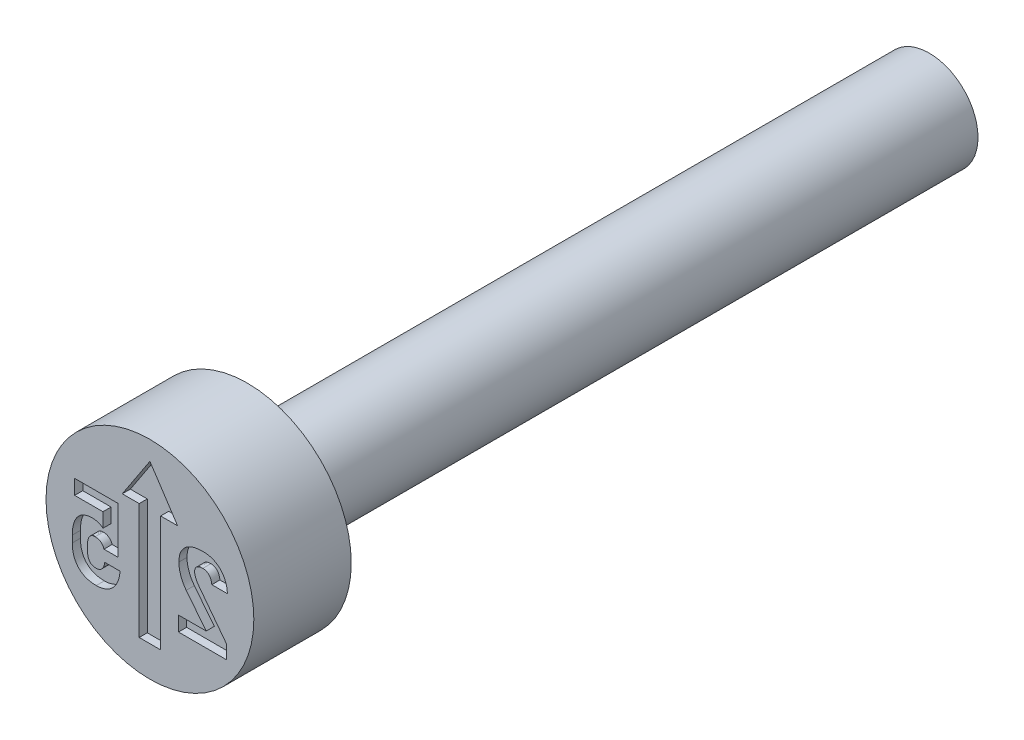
ISO-10303-21;
HEADER;
FILE_DESCRIPTION(('STEP AP214'),'2;1');
FILE_NAME('part.step','',(''),(''),'','','');
FILE_SCHEMA(('AUTOMOTIVE_DESIGN { 1 0 10303 214 1 1 1 1 }'));
ENDSEC;
DATA;
#1=APPLICATION_CONTEXT('core data for automotive mechanical design processes');
#2=APPLICATION_PROTOCOL_DEFINITION('international standard','automotive_design',2000,#1);
#3=PRODUCT_CONTEXT('',#1,'mechanical');
#4=PRODUCT('Part','Part','',(#3));
#5=PRODUCT_RELATED_PRODUCT_CATEGORY('part','',(#4));
#6=PRODUCT_DEFINITION_FORMATION('','',#4);
#7=PRODUCT_DEFINITION_CONTEXT('part definition',#1,'design');
#8=PRODUCT_DEFINITION('design','',#6,#7);
#9=PRODUCT_DEFINITION_SHAPE('','',#8);
#10=(LENGTH_UNIT() NAMED_UNIT(*) SI_UNIT(.MILLI.,.METRE.));
#11=(NAMED_UNIT(*) PLANE_ANGLE_UNIT() SI_UNIT($,.RADIAN.));
#12=(NAMED_UNIT(*) SI_UNIT($,.STERADIAN.) SOLID_ANGLE_UNIT());
#13=UNCERTAINTY_MEASURE_WITH_UNIT(LENGTH_MEASURE(1.E-05),#10,'distance_accuracy_value','');
#14=(GEOMETRIC_REPRESENTATION_CONTEXT(3) GLOBAL_UNCERTAINTY_ASSIGNED_CONTEXT((#13)) GLOBAL_UNIT_ASSIGNED_CONTEXT((#10,
#11,#12)) REPRESENTATION_CONTEXT('',''));
#15=CARTESIAN_POINT('',(0.,0.,0.));
#16=DIRECTION('',(0.,0.,1.));
#17=DIRECTION('',(1.,0.,0.));
#18=AXIS2_PLACEMENT_3D('',#15,#16,#17);
#19=CARTESIAN_POINT('',(-0.33,-2.25,-4.2002794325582));
#20=DIRECTION('',(-1.,0.,0.));
#21=DIRECTION('',(0.,0.,1.));
#22=AXIS2_PLACEMENT_3D('',#19,#20,#21);
#23=PLANE('',#22);
#24=DIRECTION('',(0.,-1.,0.));
#25=VECTOR('',#24,1.);
#26=CARTESIAN_POINT('',(-0.33,1.32083870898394,-0.24895886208));
#27=LINE('',#26,#25);
#28=CARTESIAN_POINT('',(-0.33,1.32083870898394,-0.24895886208));
#29=VERTEX_POINT('',#28);
#30=CARTESIAN_POINT('',(-0.33,-2.25,-0.24895886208));
#31=VERTEX_POINT('',#30);
#32=EDGE_CURVE('E48',#29,#31,#27,.T.);
#33=ORIENTED_EDGE('',*,*,#32,.F.);
#34=DIRECTION('',(0.,0.,1.));
#35=VECTOR('',#34,1.);
#36=CARTESIAN_POINT('',(-0.33,1.32083870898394,-0.28447943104));
#37=LINE('',#36,#35);
#38=CARTESIAN_POINT('',(-0.33,1.32083870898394,0.));
#39=VERTEX_POINT('',#38);
#40=EDGE_CURVE('E535',#39,#29,#37,.F.);
#41=ORIENTED_EDGE('',*,*,#40,.F.);
#42=DIRECTION('',(0.,1.,0.));
#43=VECTOR('',#42,1.);
#44=CARTESIAN_POINT('',(-0.33,0.,0.));
#45=LINE('',#44,#43);
#46=CARTESIAN_POINT('',(-0.33,-2.25,0.));
#47=VERTEX_POINT('',#46);
#48=EDGE_CURVE('E551',#47,#39,#45,.T.);
#49=ORIENTED_EDGE('',*,*,#48,.F.);
#50=DIRECTION('',(0.,0.,-1.));
#51=VECTOR('',#50,1.);
#52=CARTESIAN_POINT('',(-0.33,-2.25,-4.2002794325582));
#53=LINE('',#52,#51);
#54=EDGE_CURVE('E319',#47,#31,#53,.T.);
#55=ORIENTED_EDGE('',*,*,#54,.T.);
#56=EDGE_LOOP('',(#33,#41,#49,#55));
#57=FACE_BOUND('',#56,.T.);
#58=ADVANCED_FACE('F34',(#57),#23,.F.);
#59=CARTESIAN_POINT('',(5.684330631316E-13,1.32083870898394,-0.28447943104));
#60=DIRECTION('',(0.,1.,0.));
#61=DIRECTION('',(0.,0.,1.));
#62=AXIS2_PLACEMENT_3D('',#59,#60,#61);
#63=PLANE('',#62);
#64=ORIENTED_EDGE('',*,*,#40,.T.);
#65=DIRECTION('',(1.,0.,0.));
#66=VECTOR('',#65,1.);
#67=CARTESIAN_POINT('',(-0.851282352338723,1.32083870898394,-0.24895886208));
#68=LINE('',#67,#66);
#69=CARTESIAN_POINT('',(-0.851282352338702,1.32083870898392,-0.24895886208));
#70=VERTEX_POINT('',#69);
#71=EDGE_CURVE('E55',#70,#29,#68,.T.);
#72=ORIENTED_EDGE('',*,*,#71,.F.);
#73=DIRECTION('',(0.,0.,1.));
#74=VECTOR('',#73,1.);
#75=CARTESIAN_POINT('',(-0.851282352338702,1.32083870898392,-1.30047739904));
#76=LINE('',#75,#74);
#77=CARTESIAN_POINT('',(-0.851282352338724,1.32083870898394,0.));
#78=VERTEX_POINT('',#77);
#79=EDGE_CURVE('E561',#70,#78,#76,.T.);
#80=ORIENTED_EDGE('',*,*,#79,.T.);
#81=DIRECTION('',(1.,0.,0.));
#82=VECTOR('',#81,1.);
#83=CARTESIAN_POINT('',(1.59999680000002,1.32083870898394,0.));
#84=LINE('',#83,#82);
#85=EDGE_CURVE('E548',#39,#78,#84,.F.);
#86=ORIENTED_EDGE('',*,*,#85,.F.);
#87=EDGE_LOOP('',(#64,#72,#80,#86));
#88=FACE_BOUND('',#87,.T.);
#89=ADVANCED_FACE('F564',(#88),#63,.T.);
#90=CARTESIAN_POINT('',(-1.44383534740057,0.421431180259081,-1.30047739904));
#91=DIRECTION('',(-0.835059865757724,0.550159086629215,0.));
#92=DIRECTION('',(-0.550159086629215,-0.835059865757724,0.));
#93=AXIS2_PLACEMENT_3D('',#90,#91,#92);
#94=PLANE('',#93);
#95=DIRECTION('',(-0.550159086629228,-0.835059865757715,0.));
#96=VECTOR('',#95,1.);
#97=CARTESIAN_POINT('',(0.,2.61295901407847,-0.24895886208));
#98=LINE('',#97,#96);
#99=CARTESIAN_POINT('',(0.,2.61295901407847,-0.24895886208));
#100=VERTEX_POINT('',#99);
#101=EDGE_CURVE('E567',#100,#70,#98,.T.);
#102=ORIENTED_EDGE('',*,*,#101,.F.);
#103=DIRECTION('',(0.,0.,1.));
#104=VECTOR('',#103,1.);
#105=CARTESIAN_POINT('',(0.,2.61295901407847,-1.30047739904));
#106=LINE('',#105,#104);
#107=CARTESIAN_POINT('',(0.,2.61295901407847,0.));
#108=VERTEX_POINT('',#107);
#109=EDGE_CURVE('E559',#100,#108,#106,.T.);
#110=ORIENTED_EDGE('',*,*,#109,.T.);
#111=DIRECTION('',(0.550159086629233,0.835059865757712,0.));
#112=VECTOR('',#111,1.);
#113=CARTESIAN_POINT('',(-0.851282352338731,1.32083870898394,0.));
#114=LINE('',#113,#112);
#115=EDGE_CURVE('E545',#78,#108,#114,.T.);
#116=ORIENTED_EDGE('',*,*,#115,.F.);
#117=ORIENTED_EDGE('',*,*,#79,.F.);
#118=EDGE_LOOP('',(#102,#110,#116,#117));
#119=FACE_BOUND('',#118,.T.);
#120=ADVANCED_FACE('F582',(#119),#94,.F.);
#121=CARTESIAN_POINT('',(0.,2.61295901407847,-1.30047739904));
#122=DIRECTION('',(0.835059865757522,0.550159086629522,0.));
#123=DIRECTION('',(-0.550159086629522,0.835059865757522,0.));
#124=AXIS2_PLACEMENT_3D('',#121,#122,#123);
#125=PLANE('',#124);
#126=DIRECTION('',(-0.550159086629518,0.835059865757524,0.));
#127=VECTOR('',#126,1.);
#128=CARTESIAN_POINT('',(0.851282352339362,1.32083870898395,-0.24895886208));
#129=LINE('',#128,#127);
#130=CARTESIAN_POINT('',(0.851282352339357,1.32083870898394,-0.24895886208));
#131=VERTEX_POINT('',#130);
#132=EDGE_CURVE('E568',#131,#100,#129,.T.);
#133=ORIENTED_EDGE('',*,*,#132,.F.);
#134=DIRECTION('',(0.,0.,1.));
#135=VECTOR('',#134,1.);
#136=CARTESIAN_POINT('',(0.851282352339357,1.32083870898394,-0.28447943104));
#137=LINE('',#136,#135);
#138=CARTESIAN_POINT('',(0.851282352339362,1.32083870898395,0.));
#139=VERTEX_POINT('',#138);
#140=EDGE_CURVE('E556',#139,#131,#137,.F.);
#141=ORIENTED_EDGE('',*,*,#140,.F.);
#142=DIRECTION('',(0.550159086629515,-0.835059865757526,0.));
#143=VECTOR('',#142,1.);
#144=CARTESIAN_POINT('',(0.,2.61295901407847,0.));
#145=LINE('',#144,#143);
#146=EDGE_CURVE('E542',#108,#139,#145,.T.);
#147=ORIENTED_EDGE('',*,*,#146,.F.);
#148=ORIENTED_EDGE('',*,*,#109,.F.);
#149=EDGE_LOOP('',(#133,#141,#147,#148));
#150=FACE_BOUND('',#149,.T.);
#151=ADVANCED_FACE('F578',(#150),#125,.F.);
#152=CARTESIAN_POINT('',(5.684330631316E-13,1.32083870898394,-0.28447943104));
#153=DIRECTION('',(0.,1.,0.));
#154=DIRECTION('',(0.,0.,1.));
#155=AXIS2_PLACEMENT_3D('',#152,#153,#154);
#156=PLANE('',#155);
#157=ORIENTED_EDGE('',*,*,#140,.T.);
#158=DIRECTION('',(1.,0.,0.));
#159=VECTOR('',#158,1.);
#160=CARTESIAN_POINT('',(0.33,1.32083870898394,-0.24895886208));
#161=LINE('',#160,#159);
#162=CARTESIAN_POINT('',(0.33,1.32083870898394,-0.24895886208));
#163=VERTEX_POINT('',#162);
#164=EDGE_CURVE('E572',#163,#131,#161,.T.);
#165=ORIENTED_EDGE('',*,*,#164,.F.);
#166=DIRECTION('',(0.,0.,-1.));
#167=VECTOR('',#166,1.);
#168=CARTESIAN_POINT('',(0.33,1.32083870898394,-4.2002794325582));
#169=LINE('',#168,#167);
#170=CARTESIAN_POINT('',(0.33,1.32083870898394,0.));
#171=VERTEX_POINT('',#170);
#172=EDGE_CURVE('E320',#163,#171,#169,.F.);
#173=ORIENTED_EDGE('',*,*,#172,.T.);
#174=DIRECTION('',(1.,0.,0.));
#175=VECTOR('',#174,1.);
#176=CARTESIAN_POINT('',(1.59999680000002,1.32083870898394,0.));
#177=LINE('',#176,#175);
#178=EDGE_CURVE('E539',#139,#171,#177,.F.);
#179=ORIENTED_EDGE('',*,*,#178,.F.);
#180=EDGE_LOOP('',(#157,#165,#173,#179));
#181=FACE_BOUND('',#180,.T.);
#182=ADVANCED_FACE('F574',(#181),#156,.T.);
#183=CARTESIAN_POINT('',(0.33,-2.25,-4.2002794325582));
#184=DIRECTION('',(1.,0.,0.));
#185=DIRECTION('',(0.,0.,-1.));
#186=AXIS2_PLACEMENT_3D('',#183,#184,#185);
#187=PLANE('',#186);
#188=DIRECTION('',(0.,1.,0.));
#189=VECTOR('',#188,1.);
#190=CARTESIAN_POINT('',(0.33,-2.25,-0.24895886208));
#191=LINE('',#190,#189);
#192=CARTESIAN_POINT('',(0.33,-2.25,-0.24895886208));
#193=VERTEX_POINT('',#192);
#194=EDGE_CURVE('E324',#193,#163,#191,.T.);
#195=ORIENTED_EDGE('',*,*,#194,.F.);
#196=DIRECTION('',(0.,0.,-1.));
#197=VECTOR('',#196,1.);
#198=CARTESIAN_POINT('',(0.33,-2.25,-4.2002794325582));
#199=LINE('',#198,#197);
#200=CARTESIAN_POINT('',(0.33,-2.25,0.));
#201=VERTEX_POINT('',#200);
#202=EDGE_CURVE('E308',#193,#201,#199,.F.);
#203=ORIENTED_EDGE('',*,*,#202,.T.);
#204=DIRECTION('',(0.,1.,0.));
#205=VECTOR('',#204,1.);
#206=CARTESIAN_POINT('',(0.33,0.,0.));
#207=LINE('',#206,#205);
#208=EDGE_CURVE('E537',#171,#201,#207,.F.);
#209=ORIENTED_EDGE('',*,*,#208,.F.);
#210=ORIENTED_EDGE('',*,*,#172,.F.);
#211=EDGE_LOOP('',(#195,#203,#209,#210));
#212=FACE_BOUND('',#211,.T.);
#213=ADVANCED_FACE('F325',(#212),#187,.F.);
#214=CARTESIAN_POINT('',(-0.33,-2.25,-4.2002794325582));
#215=DIRECTION('',(0.,-1.,0.));
#216=DIRECTION('',(0.,0.,-1.));
#217=AXIS2_PLACEMENT_3D('',#214,#215,#216);
#218=PLANE('',#217);
#219=DIRECTION('',(1.,0.,0.));
#220=VECTOR('',#219,1.);
#221=CARTESIAN_POINT('',(-0.33,-2.25,-0.24895886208));
#222=LINE('',#221,#220);
#223=EDGE_CURVE('E313',#31,#193,#222,.T.);
#224=ORIENTED_EDGE('',*,*,#223,.F.);
#225=ORIENTED_EDGE('',*,*,#54,.F.);
#226=DIRECTION('',(1.,0.,0.));
#227=VECTOR('',#226,1.);
#228=CARTESIAN_POINT('',(1.59999680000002,-2.25,0.));
#229=LINE('',#228,#227);
#230=EDGE_CURVE('E315',#201,#47,#229,.F.);
#231=ORIENTED_EDGE('',*,*,#230,.F.);
#232=ORIENTED_EDGE('',*,*,#202,.F.);
#233=EDGE_LOOP('',(#224,#225,#231,#232));
#234=FACE_BOUND('',#233,.T.);
#235=ADVANCED_FACE('F310',(#234),#218,.F.);
#236=CARTESIAN_POINT('',(1.59999680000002,0.,0.));
#237=DIRECTION('',(0.,0.,1.));
#238=DIRECTION('',(1.,0.,0.));
#239=AXIS2_PLACEMENT_3D('',#236,#237,#238);
#240=PLANE('',#239);
#241=CARTESIAN_POINT('',(-2.38996295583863,-0.758712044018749,0.));
#242=CARTESIAN_POINT('',(-2.38884691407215,-0.7976487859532,0.));
#243=CARTESIAN_POINT('',(-2.38668789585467,-0.872973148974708,0.));
#244=CARTESIAN_POINT('',(-2.37124865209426,-0.981897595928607,0.));
#245=CARTESIAN_POINT('',(-2.34341606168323,-1.08181303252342,0.));
#246=CARTESIAN_POINT('',(-2.30612449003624,-1.1733654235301,0.));
#247=CARTESIAN_POINT('',(-2.25742947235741,-1.25473545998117,0.));
#248=CARTESIAN_POINT('',(-2.19912007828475,-1.32661050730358,0.));
#249=CARTESIAN_POINT('',(-2.13013221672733,-1.3873310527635,0.));
#250=CARTESIAN_POINT('',(-2.05209404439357,-1.43843252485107,0.));
#251=CARTESIAN_POINT('',(-1.96426302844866,-1.47762379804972,0.));
#252=CARTESIAN_POINT('',(-1.86804271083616,-1.50609497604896,0.));
#253=CARTESIAN_POINT('',(-1.76305231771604,-1.52302976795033,0.));
#254=CARTESIAN_POINT('',(-1.69034607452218,-1.52497660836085,0.));
#255=CARTESIAN_POINT('',(-1.65275080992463,-1.52598328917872,0.));
#256=B_SPLINE_CURVE_WITH_KNOTS('',3,(#241,#242,#243,#244,#245,#246,#247,#248,#249,#250,#251,
#252,#253,#254,#255),.UNSPECIFIED.,.F.,.F.,(4,1,1,1,1,1,1,1,1,1,1,1,4),(0.,0.0965919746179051,
0.1868602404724,0.272108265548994,0.35332451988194,0.431359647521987,0.506505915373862,
0.582010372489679,0.6584354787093,0.737063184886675,0.819709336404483,0.906774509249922,1.),.UNSPECIFIED.);
#257=CARTESIAN_POINT('',(-2.38996295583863,-0.758712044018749,0.));
#258=VERTEX_POINT('',#257);
#259=CARTESIAN_POINT('',(-1.65275080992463,-1.52598328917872,0.));
#260=VERTEX_POINT('',#259);
#261=EDGE_CURVE('E328',#258,#260,#256,.T.);
#262=ORIENTED_EDGE('',*,*,#261,.F.);
#263=DIRECTION('',(0.,-1.,0.));
#264=VECTOR('',#263,1.);
#265=CARTESIAN_POINT('',(-2.38996295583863,-0.549317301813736,0.));
#266=LINE('',#265,#264);
#267=CARTESIAN_POINT('',(-2.38996295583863,-0.549317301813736,0.));
#268=VERTEX_POINT('',#267);
#269=EDGE_CURVE('E342',#268,#258,#266,.T.);
#270=ORIENTED_EDGE('',*,*,#269,.F.);
#271=CARTESIAN_POINT('',(-1.77451563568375,0.215916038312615,0.));
#272=CARTESIAN_POINT('',(-1.80584769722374,0.21492405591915,0.));
#273=CARTESIAN_POINT('',(-1.86661566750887,0.213000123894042,0.));
#274=CARTESIAN_POINT('',(-1.95426851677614,0.195693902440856,0.));
#275=CARTESIAN_POINT('',(-2.03504875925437,0.167967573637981,0.));
#276=CARTESIAN_POINT('',(-2.10828982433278,0.12802196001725,0.));
#277=CARTESIAN_POINT('',(-2.17407455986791,0.0779561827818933,0.));
#278=CARTESIAN_POINT('',(-2.23121356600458,0.0167798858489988,0.));
#279=CARTESIAN_POINT('',(-2.28006304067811,-0.0545097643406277,0.));
#280=CARTESIAN_POINT('',(-2.32004214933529,-0.135960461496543,0.));
#281=CARTESIAN_POINT('',(-2.35150738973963,-0.226858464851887,0.));
#282=CARTESIAN_POINT('',(-2.37436153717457,-0.326569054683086,0.));
#283=CARTESIAN_POINT('',(-2.38738559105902,-0.43518900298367,0.));
#284=CARTESIAN_POINT('',(-2.38908390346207,-0.510391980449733,0.));
#285=CARTESIAN_POINT('',(-2.38996295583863,-0.549317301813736,0.));
#286=B_SPLINE_CURVE_WITH_KNOTS('',3,(#271,#272,#273,#274,#275,#276,#277,#278,#279,#280,#281,
#282,#283,#284,#285),.UNSPECIFIED.,.F.,.F.,(4,1,1,1,1,1,1,1,1,1,1,1,4),(0.,0.0843949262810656,
0.163682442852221,0.239848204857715,0.313806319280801,0.3876154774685,0.461788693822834,
0.538496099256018,0.61978489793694,0.70565234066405,0.797279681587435,0.895071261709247,1.),.UNSPECIFIED.);
#287=CARTESIAN_POINT('',(-1.77451563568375,0.215916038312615,0.));
#288=VERTEX_POINT('',#287);
#289=EDGE_CURVE('E769',#288,#268,#286,.T.);
#290=ORIENTED_EDGE('',*,*,#289,.F.);
#291=CARTESIAN_POINT('',(-1.44641292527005,0.104340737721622,0.));
#292=CARTESIAN_POINT('',(-1.45589794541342,0.112739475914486,0.));
#293=CARTESIAN_POINT('',(-1.47540937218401,0.130016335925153,0.));
#294=CARTESIAN_POINT('',(-1.50952095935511,0.15195312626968,0.));
#295=CARTESIAN_POINT('',(-1.5485341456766,0.170584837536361,0.));
#296=CARTESIAN_POINT('',(-1.60610172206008,0.192043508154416,0.));
#297=CARTESIAN_POINT('',(-1.68182938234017,0.211125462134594,0.));
#298=CARTESIAN_POINT('',(-1.74399649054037,0.214338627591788,0.));
#299=CARTESIAN_POINT('',(-1.77451563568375,0.215916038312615,0.));
#300=B_SPLINE_CURVE_WITH_KNOTS('',3,(#291,#292,#293,#294,#295,#296,#297,#298,#299),
.UNSPECIFIED.,.F.,.F.,(4,1,1,1,1,1,4),(0.,0.107291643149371,0.220707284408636,0.342410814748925,
0.473179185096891,0.741372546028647,1.),.UNSPECIFIED.);
#301=CARTESIAN_POINT('',(-1.44641292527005,0.104340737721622,0.));
#302=VERTEX_POINT('',#301);
#303=EDGE_CURVE('E774',#302,#288,#300,.T.);
#304=ORIENTED_EDGE('',*,*,#303,.F.);
#305=DIRECTION('',(0.,-1.,0.));
#306=VECTOR('',#305,1.);
#307=CARTESIAN_POINT('',(-1.44641292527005,0.546056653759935,0.));
#308=LINE('',#307,#306);
#309=CARTESIAN_POINT('',(-1.44641292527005,0.546056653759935,0.));
#310=VERTEX_POINT('',#309);
#311=EDGE_CURVE('E782',#310,#302,#308,.T.);
#312=ORIENTED_EDGE('',*,*,#311,.F.);
#313=DIRECTION('',(1.,0.,0.));
#314=VECTOR('',#313,1.);
#315=CARTESIAN_POINT('',(-2.31812680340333,0.546056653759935,0.));
#316=LINE('',#315,#314);
#317=CARTESIAN_POINT('',(-2.31812680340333,0.546056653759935,0.));
#318=VERTEX_POINT('',#317);
#319=EDGE_CURVE('E788',#318,#310,#316,.T.);
#320=ORIENTED_EDGE('',*,*,#319,.F.);
#321=DIRECTION('',(0.,-1.,0.));
#322=VECTOR('',#321,1.);
#323=CARTESIAN_POINT('',(-2.31812680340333,1.,0.));
#324=LINE('',#323,#322);
#325=CARTESIAN_POINT('',(-2.31812680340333,1.,0.));
#326=VERTEX_POINT('',#325);
#327=EDGE_CURVE('E791',#326,#318,#324,.T.);
#328=ORIENTED_EDGE('',*,*,#327,.F.);
#329=DIRECTION('',(-1.,0.,0.));
#330=VECTOR('',#329,1.);
#331=CARTESIAN_POINT('',(-0.975147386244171,1.,0.));
#332=LINE('',#331,#330);
#333=CARTESIAN_POINT('',(-0.975147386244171,1.,0.));
#334=VERTEX_POINT('',#333);
#335=EDGE_CURVE('E794',#334,#326,#332,.T.);
#336=ORIENTED_EDGE('',*,*,#335,.F.);
#337=DIRECTION('',(0.,1.,0.));
#338=VECTOR('',#337,1.);
#339=CARTESIAN_POINT('',(-0.975147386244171,-0.437232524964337,0.));
#340=LINE('',#339,#338);
#341=CARTESIAN_POINT('',(-0.975147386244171,-0.437232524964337,0.));
#342=VERTEX_POINT('',#341);
#343=EDGE_CURVE('E797',#342,#334,#340,.T.);
#344=ORIENTED_EDGE('',*,*,#343,.F.);
#345=DIRECTION('',(1.,0.,0.));
#346=VECTOR('',#345,1.);
#347=CARTESIAN_POINT('',(-1.41533487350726,-0.437232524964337,0.));
#348=LINE('',#347,#346);
#349=CARTESIAN_POINT('',(-1.41533487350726,-0.437232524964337,0.));
#350=VERTEX_POINT('',#349);
#351=EDGE_CURVE('E800',#350,#342,#348,.T.);
#352=ORIENTED_EDGE('',*,*,#351,.F.);
#353=CARTESIAN_POINT('',(-1.68688571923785,-0.241084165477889,0.));
#354=CARTESIAN_POINT('',(-1.67052903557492,-0.241583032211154,0.));
#355=CARTESIAN_POINT('',(-1.63886310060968,-0.242548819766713,0.));
#356=CARTESIAN_POINT('',(-1.59326911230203,-0.252549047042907,0.));
#357=CARTESIAN_POINT('',(-1.5513637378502,-0.268910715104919,0.));
#358=CARTESIAN_POINT('',(-1.51362268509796,-0.292043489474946,0.));
#359=CARTESIAN_POINT('',(-1.48028910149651,-0.320395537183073,0.));
#360=CARTESIAN_POINT('',(-1.45284510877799,-0.354653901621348,0.));
#361=CARTESIAN_POINT('',(-1.42983920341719,-0.393363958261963,0.));
#362=CARTESIAN_POINT('',(-1.42023989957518,-0.42239719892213,0.));
#363=CARTESIAN_POINT('',(-1.41533487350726,-0.437232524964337,0.));
#364=B_SPLINE_CURVE_WITH_KNOTS('',3,(#353,#354,#355,#356,#357,#358,#359,#360,#361,#362,#363),
.UNSPECIFIED.,.F.,.F.,(4,1,1,1,1,1,1,1,4),(0.,0.135635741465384,0.262585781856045,
0.385395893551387,0.507524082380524,0.628507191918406,0.746772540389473,0.870606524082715,1.),.UNSPECIFIED.);
#365=CARTESIAN_POINT('',(-1.68688571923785,-0.241084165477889,0.));
#366=VERTEX_POINT('',#365);
#367=EDGE_CURVE('E803',#366,#350,#364,.T.);
#368=ORIENTED_EDGE('',*,*,#367,.F.);
#369=CARTESIAN_POINT('',(-1.91920689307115,-0.549317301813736,0.));
#370=CARTESIAN_POINT('',(-1.91870373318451,-0.525989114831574,0.));
#371=CARTESIAN_POINT('',(-1.91774880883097,-0.481715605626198,0.));
#372=CARTESIAN_POINT('',(-1.90586958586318,-0.419783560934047,0.));
#373=CARTESIAN_POINT('',(-1.88739974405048,-0.365749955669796,0.));
#374=CARTESIAN_POINT('',(-1.86012236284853,-0.320894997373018,0.));
#375=CARTESIAN_POINT('',(-1.82621377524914,-0.2846900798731,0.));
#376=CARTESIAN_POINT('',(-1.78518019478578,-0.258975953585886,0.));
#377=CARTESIAN_POINT('',(-1.73784579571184,-0.243788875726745,0.));
#378=CARTESIAN_POINT('',(-1.70432224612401,-0.242009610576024,0.));
#379=CARTESIAN_POINT('',(-1.68688571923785,-0.241084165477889,0.));
#380=B_SPLINE_CURVE_WITH_KNOTS('',3,(#369,#370,#371,#372,#373,#374,#375,#376,#377,#378,#379),
.UNSPECIFIED.,.F.,.F.,(4,1,1,1,1,1,1,1,4),(0.,0.160198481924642,0.304033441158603,
0.431843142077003,0.550810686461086,0.662316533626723,0.769888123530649,0.880312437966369,1.),.UNSPECIFIED.);
#381=CARTESIAN_POINT('',(-1.91920689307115,-0.549317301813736,0.));
#382=VERTEX_POINT('',#381);
#383=EDGE_CURVE('E808',#382,#366,#380,.T.);
#384=ORIENTED_EDGE('',*,*,#383,.F.);
#385=DIRECTION('',(0.,1.,0.));
#386=VECTOR('',#385,1.);
#387=CARTESIAN_POINT('',(-1.91920689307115,-0.758712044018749,0.));
#388=LINE('',#387,#386);
#389=CARTESIAN_POINT('',(-1.91920689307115,-0.758712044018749,0.));
#390=VERTEX_POINT('',#389);
#391=EDGE_CURVE('E816',#390,#382,#388,.T.);
#392=ORIENTED_EDGE('',*,*,#391,.F.);
#393=CARTESIAN_POINT('',(-1.65937400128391,-1.06847360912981,0.));
#394=CARTESIAN_POINT('',(-1.67902314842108,-1.06761760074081,0.));
#395=CARTESIAN_POINT('',(-1.7166068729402,-1.06598027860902,0.));
#396=CARTESIAN_POINT('',(-1.76928668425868,-1.05017773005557,0.));
#397=CARTESIAN_POINT('',(-1.8151464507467,-1.02487774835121,0.));
#398=CARTESIAN_POINT('',(-1.85302668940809,-0.988472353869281,0.));
#399=CARTESIAN_POINT('',(-1.88324546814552,-0.943111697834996,0.));
#400=CARTESIAN_POINT('',(-1.90463605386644,-0.88879216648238,0.));
#401=CARTESIAN_POINT('',(-1.91730423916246,-0.826375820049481,0.));
#402=CARTESIAN_POINT('',(-1.91855088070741,-0.782041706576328,0.));
#403=CARTESIAN_POINT('',(-1.91920689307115,-0.758712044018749,0.));
#404=B_SPLINE_CURVE_WITH_KNOTS('',3,(#393,#394,#395,#396,#397,#398,#399,#400,#401,#402,#403),
.UNSPECIFIED.,.F.,.F.,(4,1,1,1,1,1,1,1,4),(0.,0.128261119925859,0.245330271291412,
0.356275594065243,0.467886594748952,0.585607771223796,0.710231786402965,0.847517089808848,1.),.UNSPECIFIED.);
#405=CARTESIAN_POINT('',(-1.65937400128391,-1.06847360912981,0.));
#406=VERTEX_POINT('',#405);
#407=EDGE_CURVE('E822',#406,#390,#404,.T.);
#408=ORIENTED_EDGE('',*,*,#407,.F.);
#409=CARTESIAN_POINT('',(-1.39138948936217,-0.777562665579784,0.));
#410=CARTESIAN_POINT('',(-1.39407981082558,-0.799444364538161,0.));
#411=CARTESIAN_POINT('',(-1.39920686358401,-0.841145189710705,0.));
#412=CARTESIAN_POINT('',(-1.41769504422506,-0.899014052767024,0.));
#413=CARTESIAN_POINT('',(-1.44183255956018,-0.949880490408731,0.));
#414=CARTESIAN_POINT('',(-1.47371632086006,-0.992561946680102,0.));
#415=CARTESIAN_POINT('',(-1.51157844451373,-1.02721320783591,0.));
#416=CARTESIAN_POINT('',(-1.55644380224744,-1.05071451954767,0.));
#417=CARTESIAN_POINT('',(-1.60602911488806,-1.06639669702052,0.));
#418=CARTESIAN_POINT('',(-1.64124606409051,-1.06776782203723,0.));
#419=CARTESIAN_POINT('',(-1.65937400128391,-1.06847360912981,0.));
#420=B_SPLINE_CURVE_WITH_KNOTS('',3,(#409,#410,#411,#412,#413,#414,#415,#416,#417,#418,#419),
.UNSPECIFIED.,.F.,.F.,(4,1,1,1,1,1,1,1,4),(0.,0.150277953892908,0.286390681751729,
0.412971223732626,0.533144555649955,0.648163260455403,0.760273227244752,0.876600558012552,1.),.UNSPECIFIED.);
#421=CARTESIAN_POINT('',(-1.39138948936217,-0.777562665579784,0.));
#422=VERTEX_POINT('',#421);
#423=EDGE_CURVE('E827',#422,#406,#420,.T.);
#424=ORIENTED_EDGE('',*,*,#423,.F.);
#425=DIRECTION('',(0.,-1.,0.));
#426=VECTOR('',#425,1.);
#427=CARTESIAN_POINT('',(-1.39138948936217,-0.776034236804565,0.));
#428=LINE('',#427,#426);
#429=CARTESIAN_POINT('',(-1.39138948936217,-0.776034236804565,0.));
#430=VERTEX_POINT('',#429);
#431=EDGE_CURVE('E835',#430,#422,#428,.T.);
#432=ORIENTED_EDGE('',*,*,#431,.F.);
#433=DIRECTION('',(-1.,0.,0.));
#434=VECTOR('',#433,1.);
#435=CARTESIAN_POINT('',(-0.920123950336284,-0.776034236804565,0.));
#436=LINE('',#435,#434);
#437=CARTESIAN_POINT('',(-0.920123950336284,-0.776034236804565,0.));
#438=VERTEX_POINT('',#437);
#439=EDGE_CURVE('E841',#438,#430,#436,.T.);
#440=ORIENTED_EDGE('',*,*,#439,.F.);
#441=DIRECTION('',(0.,1.,0.));
#442=VECTOR('',#441,1.);
#443=CARTESIAN_POINT('',(-0.920123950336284,-0.777562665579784,0.));
#444=LINE('',#443,#442);
#445=CARTESIAN_POINT('',(-0.920123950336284,-0.777562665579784,0.));
#446=VERTEX_POINT('',#445);
#447=EDGE_CURVE('E844',#446,#438,#444,.T.);
#448=ORIENTED_EDGE('',*,*,#447,.F.);
#449=CARTESIAN_POINT('',(-1.65275080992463,-1.52598328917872,0.));
#450=CARTESIAN_POINT('',(-1.61989333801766,-1.5249808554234,0.));
#451=CARTESIAN_POINT('',(-1.55559690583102,-1.52301926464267,0.));
#452=CARTESIAN_POINT('',(-1.46187556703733,-1.50540958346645,0.));
#453=CARTESIAN_POINT('',(-1.37302469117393,-1.47813780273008,0.));
#454=CARTESIAN_POINT('',(-1.28970497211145,-1.43923274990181,0.));
#455=CARTESIAN_POINT('',(-1.21282176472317,-1.38980504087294,0.));
#456=CARTESIAN_POINT('',(-1.14407479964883,-1.32936347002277,0.));
#457=CARTESIAN_POINT('',(-1.08283350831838,-1.2594905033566,0.));
#458=CARTESIAN_POINT('',(-1.0303259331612,-1.17957449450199,0.));
#459=CARTESIAN_POINT('',(-0.987083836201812,-1.09047037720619,0.));
#460=CARTESIAN_POINT('',(-0.95341910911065,-0.993228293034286,0.));
#461=CARTESIAN_POINT('',(-0.930296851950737,-0.888023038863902,0.));
#462=CARTESIAN_POINT('',(-0.92357484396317,-0.815033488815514,0.));
#463=CARTESIAN_POINT('',(-0.920123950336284,-0.777562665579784,0.));
#464=B_SPLINE_CURVE_WITH_KNOTS('',3,(#449,#450,#451,#452,#453,#454,#455,#456,#457,#458,#459,
#460,#461,#462,#463),.UNSPECIFIED.,.F.,.F.,(4,1,1,1,1,1,1,1,1,1,1,1,4),(0.,0.0844304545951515,
0.165215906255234,0.244369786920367,0.322918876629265,0.400936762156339,0.47863123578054,
0.557558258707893,0.639203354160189,0.723781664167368,0.811629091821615,0.903295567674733,1.),.UNSPECIFIED.);
#465=EDGE_CURVE('E847',#260,#446,#464,.T.);
#466=ORIENTED_EDGE('',*,*,#465,.F.);
#467=EDGE_LOOP('',(#262,#270,#290,#304,#312,#320,#328,#336,#344,#352,#368,#384,#392,#408,#424,
#432,#440,#448,#466));
#468=FACE_BOUND('',#467,.T.);
#469=DIRECTION('',(0.,1.,0.));
#470=VECTOR('',#469,1.);
#471=CARTESIAN_POINT('',(2.35735719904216,-1.5,0.));
#472=LINE('',#471,#470);
#473=CARTESIAN_POINT('',(2.35735719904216,-1.5,0.));
#474=VERTEX_POINT('',#473);
#475=CARTESIAN_POINT('',(2.35735719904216,-1.0750968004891,0.));
#476=VERTEX_POINT('',#475);
#477=EDGE_CURVE('E413',#474,#476,#472,.T.);
#478=ORIENTED_EDGE('',*,*,#477,.F.);
#479=DIRECTION('',(1.,0.,0.));
#480=VECTOR('',#479,1.);
#481=CARTESIAN_POINT('',(0.878857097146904,-1.5,0.));
#482=LINE('',#481,#480);
#483=CARTESIAN_POINT('',(0.878857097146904,-1.5,0.));
#484=VERTEX_POINT('',#483);
#485=EDGE_CURVE('E491',#484,#474,#482,.T.);
#486=ORIENTED_EDGE('',*,*,#485,.F.);
#487=DIRECTION('',(0.,-1.,0.));
#488=VECTOR('',#487,1.);
#489=CARTESIAN_POINT('',(0.878857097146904,-1.04605665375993,0.));
#490=LINE('',#489,#488);
#491=CARTESIAN_POINT('',(0.878857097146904,-1.04605665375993,0.));
#492=VERTEX_POINT('',#491);
#493=EDGE_CURVE('E488',#492,#484,#490,.T.);
#494=ORIENTED_EDGE('',*,*,#493,.F.);
#495=DIRECTION('',(-1.,0.,0.));
#496=VECTOR('',#495,1.);
#497=CARTESIAN_POINT('',(1.73324878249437,-1.04605665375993,0.));
#498=LINE('',#497,#496);
#499=CARTESIAN_POINT('',(1.73324878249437,-1.04605665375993,0.));
#500=VERTEX_POINT('',#499);
#501=EDGE_CURVE('E485',#500,#492,#498,.T.);
#502=ORIENTED_EDGE('',*,*,#501,.F.);
#503=DIRECTION('',(0.620676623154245,-0.78406666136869,0.));
#504=VECTOR('',#503,1.);
#505=CARTESIAN_POINT('',(1.11780146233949,-0.268595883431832,0.));
#506=LINE('',#505,#504);
#507=CARTESIAN_POINT('',(1.11780146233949,-0.268595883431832,0.));
#508=VERTEX_POINT('',#507);
#509=EDGE_CURVE('E479',#508,#500,#506,.T.);
#510=ORIENTED_EDGE('',*,*,#509,.F.);
#511=CARTESIAN_POINT('',(0.892612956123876,0.372325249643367,0.));
#512=CARTESIAN_POINT('',(0.893266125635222,0.343928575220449,0.));
#513=CARTESIAN_POINT('',(0.894573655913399,0.287083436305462,0.));
#514=CARTESIAN_POINT('',(0.906235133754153,0.202158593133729,0.));
#515=CARTESIAN_POINT('',(0.925303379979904,0.117724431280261,0.));
#516=CARTESIAN_POINT('',(0.951176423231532,0.034076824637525,0.));
#517=CARTESIAN_POINT('',(0.983484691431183,-0.0473874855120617,0.));
#518=CARTESIAN_POINT('',(1.02204238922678,-0.125370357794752,0.));
#519=CARTESIAN_POINT('',(1.06606364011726,-0.199672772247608,0.));
#520=CARTESIAN_POINT('',(1.10055793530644,-0.245624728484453,0.));
#521=CARTESIAN_POINT('',(1.11780146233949,-0.268595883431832,0.));
#522=B_SPLINE_CURVE_WITH_KNOTS('',3,(#511,#512,#513,#514,#515,#516,#517,#518,#519,#520,#521),
.UNSPECIFIED.,.F.,.F.,(4,1,1,1,1,1,1,1,4),(0.,0.123148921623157,0.24652244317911,
0.371108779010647,0.498350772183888,0.625999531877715,0.750879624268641,0.875465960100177,1.),.UNSPECIFIED.);
#523=CARTESIAN_POINT('',(0.892612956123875,0.372325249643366,0.));
#524=VERTEX_POINT('',#523);
#525=EDGE_CURVE('E474',#524,#508,#522,.T.);
#526=ORIENTED_EDGE('',*,*,#525,.F.);
#527=DIRECTION('',(0.,-1.,0.));
#528=VECTOR('',#527,1.);
#529=CARTESIAN_POINT('',(0.892612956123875,0.374363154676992,0.));
#530=LINE('',#529,#528);
#531=CARTESIAN_POINT('',(0.892612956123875,0.374363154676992,0.));
#532=VERTEX_POINT('',#531);
#533=EDGE_CURVE('E468',#532,#524,#530,.T.);
#534=ORIENTED_EDGE('',*,*,#533,.F.);
#535=CARTESIAN_POINT('',(1.6318630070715,1.02598328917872,0.));
#536=CARTESIAN_POINT('',(1.59428482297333,1.02519770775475,0.));
#537=CARTESIAN_POINT('',(1.52155454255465,1.02367726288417,0.));
#538=CARTESIAN_POINT('',(1.41682782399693,1.0093640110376,0.));
#539=CARTESIAN_POINT('',(1.32052979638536,0.985545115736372,0.));
#540=CARTESIAN_POINT('',(1.23290204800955,0.9520805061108,0.));
#541=CARTESIAN_POINT('',(1.15451998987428,0.909062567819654,0.));
#542=CARTESIAN_POINT('',(1.08502086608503,0.858000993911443,0.));
#543=CARTESIAN_POINT('',(1.02636696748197,0.796913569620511,0.));
#544=CARTESIAN_POINT('',(0.977578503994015,0.727517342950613,0.));
#545=CARTESIAN_POINT('',(0.939118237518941,0.650080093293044,0.));
#546=CARTESIAN_POINT('',(0.912184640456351,0.564668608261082,0.));
#547=CARTESIAN_POINT('',(0.895690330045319,0.47196896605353,0.));
#548=CARTESIAN_POINT('',(0.893659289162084,0.407549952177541,0.));
#549=CARTESIAN_POINT('',(0.892612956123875,0.374363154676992,0.));
#550=B_SPLINE_CURVE_WITH_KNOTS('',3,(#535,#536,#537,#538,#539,#540,#541,#542,#543,#544,#545,
#546,#547,#548,#549),.UNSPECIFIED.,.F.,.F.,(4,1,1,1,1,1,1,1,1,1,1,1,4),(0.,0.100715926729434,
0.194929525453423,0.2827284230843,0.366191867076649,0.44566981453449,0.521804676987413,
0.596515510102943,0.671682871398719,0.748455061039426,0.827368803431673,0.911065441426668,1.),.UNSPECIFIED.);
#551=CARTESIAN_POINT('',(1.6318630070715,1.02598328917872,0.));
#552=VERTEX_POINT('',#551);
#553=EDGE_CURVE('E460',#552,#532,#550,.T.);
#554=ORIENTED_EDGE('',*,*,#553,.F.);
#555=CARTESIAN_POINT('',(2.38843525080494,0.27807214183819,0.));
#556=CARTESIAN_POINT('',(2.3849746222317,0.315709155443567,0.));
#557=CARTESIAN_POINT('',(2.37823310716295,0.389028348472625,0.));
#558=CARTESIAN_POINT('',(2.35531004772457,0.494467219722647,0.));
#559=CARTESIAN_POINT('',(2.32144603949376,0.591486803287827,0.));
#560=CARTESIAN_POINT('',(2.27818006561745,0.680354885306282,0.));
#561=CARTESIAN_POINT('',(2.22512843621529,0.759949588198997,0.));
#562=CARTESIAN_POINT('',(2.16357276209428,0.830249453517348,0.));
#563=CARTESIAN_POINT('',(2.09283127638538,0.889888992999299,0.));
#564=CARTESIAN_POINT('',(2.01412931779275,0.939447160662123,0.));
#565=CARTESIAN_POINT('',(1.92781063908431,0.97823144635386,0.));
#566=CARTESIAN_POINT('',(1.83493087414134,1.00649001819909,0.));
#567=CARTESIAN_POINT('',(1.73535013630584,1.02278077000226,0.));
#568=CARTESIAN_POINT('',(1.66690638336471,1.02489883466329,0.));
#569=CARTESIAN_POINT('',(1.6318630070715,1.02598328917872,0.));
#570=B_SPLINE_CURVE_WITH_KNOTS('',3,(#555,#556,#557,#558,#559,#560,#561,#562,#563,#564,#565,
#566,#567,#568,#569),.UNSPECIFIED.,.F.,.F.,(4,1,1,1,1,1,1,1,1,1,1,1,4),(0.,0.0953291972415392,
0.185707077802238,0.271513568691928,0.35413169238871,0.434493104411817,0.512233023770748,
0.58917600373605,0.667186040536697,0.746219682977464,0.827302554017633,0.911578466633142,1.),.UNSPECIFIED.);
#571=CARTESIAN_POINT('',(2.38843525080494,0.27807214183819,0.));
#572=VERTEX_POINT('',#571);
#573=EDGE_CURVE('E455',#572,#552,#570,.T.);
#574=ORIENTED_EDGE('',*,*,#573,.F.);
#575=DIRECTION('',(0.,1.,0.));
#576=VECTOR('',#575,1.);
#577=CARTESIAN_POINT('',(2.38843525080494,0.276034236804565,0.));
#578=LINE('',#577,#576);
#579=CARTESIAN_POINT('',(2.38843525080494,0.276034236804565,0.));
#580=VERTEX_POINT('',#579);
#581=EDGE_CURVE('E452',#580,#572,#578,.T.);
#582=ORIENTED_EDGE('',*,*,#581,.F.);
#583=DIRECTION('',(1.,0.,0.));
#584=VECTOR('',#583,1.);
#585=CARTESIAN_POINT('',(1.90545175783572,0.276034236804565,0.));
#586=LINE('',#585,#584);
#587=CARTESIAN_POINT('',(1.90545175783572,0.276034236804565,0.));
#588=VERTEX_POINT('',#587);
#589=EDGE_CURVE('E449',#588,#580,#586,.T.);
#590=ORIENTED_EDGE('',*,*,#589,.F.);
#591=DIRECTION('',(0.,-1.,0.));
#592=VECTOR('',#591,1.);
#593=CARTESIAN_POINT('',(1.90545175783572,0.27807214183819,0.));
#594=LINE('',#593,#592);
#595=CARTESIAN_POINT('',(1.90545175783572,0.27807214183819,0.));
#596=VERTEX_POINT('',#595);
#597=EDGE_CURVE('E443',#596,#588,#594,.T.);
#598=ORIENTED_EDGE('',*,*,#597,.F.);
#599=CARTESIAN_POINT('',(1.62829667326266,0.572039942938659,0.));
#600=CARTESIAN_POINT('',(1.64690218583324,0.571254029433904,0.));
#601=CARTESIAN_POINT('',(1.68300959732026,0.569728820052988,0.));
#602=CARTESIAN_POINT('',(1.73437265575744,0.555195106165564,0.));
#603=CARTESIAN_POINT('',(1.78000020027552,0.530521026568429,0.));
#604=CARTESIAN_POINT('',(1.81949822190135,0.496420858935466,0.));
#605=CARTESIAN_POINT('',(1.85264064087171,0.453522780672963,0.));
#606=CARTESIAN_POINT('',(1.87706906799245,0.401844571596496,0.));
#607=CARTESIAN_POINT('',(1.89674168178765,0.343110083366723,0.));
#608=CARTESIAN_POINT('',(1.90245064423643,0.300481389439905,0.));
#609=CARTESIAN_POINT('',(1.90545175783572,0.27807214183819,0.));
#610=B_SPLINE_CURVE_WITH_KNOTS('',3,(#599,#600,#601,#602,#603,#604,#605,#606,#607,#608,#609),
.UNSPECIFIED.,.F.,.F.,(4,1,1,1,1,1,1,1,4),(0.,0.124212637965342,0.241057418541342,
0.353359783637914,0.468536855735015,0.587568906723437,0.713021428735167,0.849139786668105,1.),.UNSPECIFIED.);
#611=CARTESIAN_POINT('',(1.62829667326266,0.572039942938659,0.));
#612=VERTEX_POINT('',#611);
#613=EDGE_CURVE('E435',#612,#596,#610,.T.);
#614=ORIENTED_EDGE('',*,*,#613,.F.);
#615=CARTESIAN_POINT('',(1.37763435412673,0.36060729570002,0.));
#616=CARTESIAN_POINT('',(1.37831808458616,0.376660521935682,0.));
#617=CARTESIAN_POINT('',(1.3796210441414,0.407252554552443,0.));
#618=CARTESIAN_POINT('',(1.39219993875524,0.450292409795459,0.));
#619=CARTESIAN_POINT('',(1.41300044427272,0.487510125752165,0.));
#620=CARTESIAN_POINT('',(1.44213631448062,0.518709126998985,0.));
#621=CARTESIAN_POINT('',(1.47919732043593,0.542687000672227,0.));
#622=CARTESIAN_POINT('',(1.52291312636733,0.560202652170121,0.));
#623=CARTESIAN_POINT('',(1.57351604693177,0.570113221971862,0.));
#624=CARTESIAN_POINT('',(1.60940220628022,0.571375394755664,0.));
#625=CARTESIAN_POINT('',(1.62829667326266,0.572039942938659,0.));
#626=B_SPLINE_CURVE_WITH_KNOTS('',3,(#615,#616,#617,#618,#619,#620,#621,#622,#623,#624,#625),
.UNSPECIFIED.,.F.,.F.,(4,1,1,1,1,1,1,1,4),(0.,0.129170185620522,0.246154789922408,
0.35773418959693,0.470108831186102,0.586692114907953,0.710769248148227,0.847716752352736,1.),.UNSPECIFIED.);
#627=CARTESIAN_POINT('',(1.37763435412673,0.36060729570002,0.));
#628=VERTEX_POINT('',#627);
#629=EDGE_CURVE('E430',#628,#612,#626,.T.);
#630=ORIENTED_EDGE('',*,*,#629,.F.);
#631=DIRECTION('',(0.,1.,0.));
#632=VECTOR('',#631,1.);
#633=CARTESIAN_POINT('',(1.37763435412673,0.357040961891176,0.));
#634=LINE('',#633,#632);
#635=CARTESIAN_POINT('',(1.37763435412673,0.357040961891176,0.));
#636=VERTEX_POINT('',#635);
#637=EDGE_CURVE('E424',#636,#628,#634,.T.);
#638=ORIENTED_EDGE('',*,*,#637,.F.);
#639=CARTESIAN_POINT('',(1.49939917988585,0.0528836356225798,0.));
#640=CARTESIAN_POINT('',(1.48140547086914,0.0778482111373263,0.));
#641=CARTESIAN_POINT('',(1.44627800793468,0.126584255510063,0.));
#642=CARTESIAN_POINT('',(1.41484978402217,0.193804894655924,0.));
#643=CARTESIAN_POINT('',(1.39488445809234,0.246512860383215,0.));
#644=CARTESIAN_POINT('',(1.38565406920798,0.284746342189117,0.));
#645=CARTESIAN_POINT('',(1.37882103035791,0.321306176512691,0.));
#646=CARTESIAN_POINT('',(1.3780244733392,0.345293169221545,0.));
#647=CARTESIAN_POINT('',(1.37763435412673,0.357040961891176,0.));
#648=B_SPLINE_CURVE_WITH_KNOTS('',3,(#639,#640,#641,#642,#643,#644,#645,#646,#647),
.UNSPECIFIED.,.F.,.F.,(4,1,1,1,1,1,4),(0.,0.27673722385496,0.540248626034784,0.66563356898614,
0.784034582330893,0.894229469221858,1.),.UNSPECIFIED.);
#649=CARTESIAN_POINT('',(1.49939917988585,0.0528836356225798,0.));
#650=VERTEX_POINT('',#649);
#651=EDGE_CURVE('E419',#650,#636,#648,.T.);
#652=ORIENTED_EDGE('',*,*,#651,.F.);
#653=DIRECTION('',(-0.60539313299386,0.795926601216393,0.));
#654=VECTOR('',#653,1.);
#655=CARTESIAN_POINT('',(2.35735719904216,-1.0750968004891,0.));
#656=LINE('',#655,#654);
#657=EDGE_CURVE('E415',#476,#650,#656,.T.);
#658=ORIENTED_EDGE('',*,*,#657,.F.);
#659=EDGE_LOOP('',(#478,#486,#494,#502,#510,#526,#534,#554,#574,#582,#590,#598,#614,#630,#638,
#652,#658));
#660=FACE_BOUND('',#659,.T.);
#661=CARTESIAN_POINT('',(0.,0.,0.));
#662=DIRECTION('',(0.,0.,-1.));
#663=DIRECTION('',(-1.,0.,0.));
#664=AXIS2_PLACEMENT_3D('',#661,#662,#663);
#665=CIRCLE('',#664,3.1999936);
#666=CARTESIAN_POINT('',(-3.1999936,0.,0.));
#667=VERTEX_POINT('',#666);
#668=EDGE_CURVE('E37',#667,#667,#665,.T.);
#669=ORIENTED_EDGE('',*,*,#668,.F.);
#670=EDGE_LOOP('',(#669));
#671=FACE_BOUND('',#670,.T.);
#672=ORIENTED_EDGE('',*,*,#208,.T.);
#673=ORIENTED_EDGE('',*,*,#230,.T.);
#674=ORIENTED_EDGE('',*,*,#48,.T.);
#675=ORIENTED_EDGE('',*,*,#85,.T.);
#676=ORIENTED_EDGE('',*,*,#115,.T.);
#677=ORIENTED_EDGE('',*,*,#146,.T.);
#678=ORIENTED_EDGE('',*,*,#178,.T.);
#679=EDGE_LOOP('',(#672,#673,#674,#675,#676,#677,#678));
#680=FACE_BOUND('',#679,.T.);
#681=ADVANCED_FACE('F584',(#468,#660,#671,#680),#240,.T.);
#682=CARTESIAN_POINT('',(0.,0.,-1.499997));
#683=DIRECTION('',(0.,0.,-1.));
#684=DIRECTION('',(-1.,0.,0.));
#685=AXIS2_PLACEMENT_3D('',#682,#683,#684);
#686=CYLINDRICAL_SURFACE('',#685,3.1999936);
#687=ORIENTED_EDGE('',*,*,#668,.T.);
#688=EDGE_LOOP('',(#687));
#689=FACE_BOUND('',#688,.T.);
#690=CARTESIAN_POINT('',(0.,0.,-2.999994));
#691=DIRECTION('',(0.,0.,-1.));
#692=DIRECTION('',(-1.,0.,0.));
#693=AXIS2_PLACEMENT_3D('',#690,#691,#692);
#694=CIRCLE('',#693,3.1999936);
#695=CARTESIAN_POINT('',(-3.1999936,0.,-2.999994));
#696=VERTEX_POINT('',#695);
#697=EDGE_CURVE('E11',#696,#696,#694,.T.);
#698=ORIENTED_EDGE('',*,*,#697,.F.);
#699=EDGE_LOOP('',(#698));
#700=FACE_BOUND('',#699,.T.);
#701=ADVANCED_FACE('F605',(#689,#700),#686,.T.);
#702=CARTESIAN_POINT('',(2.47499505,0.,-2.999994));
#703=DIRECTION('',(0.,0.,-1.));
#704=DIRECTION('',(-1.,0.,0.));
#705=AXIS2_PLACEMENT_3D('',#702,#703,#704);
#706=PLANE('',#705);
#707=ORIENTED_EDGE('',*,*,#697,.T.);
#708=EDGE_LOOP('',(#707));
#709=FACE_BOUND('',#708,.T.);
#710=CARTESIAN_POINT('',(-1.56512724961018E-13,0.,-2.99999400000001));
#711=DIRECTION('',(0.,0.,1.));
#712=DIRECTION('',(1.,0.,0.));
#713=AXIS2_PLACEMENT_3D('',#710,#711,#712);
#714=CIRCLE('',#713,1.50000000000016);
#715=CARTESIAN_POINT('',(1.5,0.,-2.999994));
#716=VERTEX_POINT('',#715);
#717=EDGE_CURVE('E532',#716,#716,#714,.T.);
#718=ORIENTED_EDGE('',*,*,#717,.T.);
#719=EDGE_LOOP('',(#718));
#720=FACE_BOUND('',#719,.T.);
#721=ADVANCED_FACE('F602',(#709,#720),#706,.T.);
#722=CARTESIAN_POINT('',(0.,0.,-23.999952));
#723=DIRECTION('',(0.,0.,1.));
#724=DIRECTION('',(1.,0.,0.));
#725=AXIS2_PLACEMENT_3D('',#722,#723,#724);
#726=CYLINDRICAL_SURFACE('',#725,1.50000000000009);
#727=ORIENTED_EDGE('',*,*,#717,.F.);
#728=EDGE_LOOP('',(#727));
#729=FACE_BOUND('',#728,.T.);
#730=CARTESIAN_POINT('',(0.,0.,-23.999952));
#731=DIRECTION('',(0.,0.,1.));
#732=DIRECTION('',(1.,0.,0.));
#733=AXIS2_PLACEMENT_3D('',#730,#731,#732);
#734=CIRCLE('',#733,1.50000000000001);
#735=CARTESIAN_POINT('',(1.5,0.,-23.999952));
#736=VERTEX_POINT('',#735);
#737=EDGE_CURVE('E497',#736,#736,#734,.T.);
#738=ORIENTED_EDGE('',*,*,#737,.T.);
#739=EDGE_LOOP('',(#738));
#740=FACE_BOUND('',#739,.T.);
#741=ADVANCED_FACE('F607',(#729,#740),#726,.T.);
#742=CARTESIAN_POINT('',(0.874998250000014,0.,-23.999952));
#743=DIRECTION('',(0.,0.,-1.));
#744=DIRECTION('',(-1.,0.,0.));
#745=AXIS2_PLACEMENT_3D('',#742,#743,#744);
#746=PLANE('',#745);
#747=ORIENTED_EDGE('',*,*,#737,.F.);
#748=EDGE_LOOP('',(#747));
#749=FACE_BOUND('',#748,.T.);
#750=ADVANCED_FACE('F614',(#749),#746,.T.);
#751=CARTESIAN_POINT('',(2.35735719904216,-1.5,-0.25));
#752=DIRECTION('',(1.,0.,0.));
#753=DIRECTION('',(0.,0.,-1.));
#754=AXIS2_PLACEMENT_3D('',#751,#752,#753);
#755=PLANE('',#754);
#756=ORIENTED_EDGE('',*,*,#477,.T.);
#757=DIRECTION('',(0.,0.,1.));
#758=VECTOR('',#757,1.);
#759=CARTESIAN_POINT('',(2.35735719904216,-1.0750968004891,-0.25));
#760=LINE('',#759,#758);
#761=CARTESIAN_POINT('',(2.35735719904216,-1.0750968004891,-0.25));
#762=VERTEX_POINT('',#761);
#763=EDGE_CURVE('E412',#762,#476,#760,.T.);
#764=ORIENTED_EDGE('',*,*,#763,.F.);
#765=DIRECTION('',(0.,1.,0.));
#766=VECTOR('',#765,1.);
#767=CARTESIAN_POINT('',(2.35735719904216,-1.5,-0.25));
#768=LINE('',#767,#766);
#769=CARTESIAN_POINT('',(2.35735719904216,-1.5,-0.25));
#770=VERTEX_POINT('',#769);
#771=EDGE_CURVE('E494',#770,#762,#768,.T.);
#772=ORIENTED_EDGE('',*,*,#771,.F.);
#773=DIRECTION('',(0.,0.,1.));
#774=VECTOR('',#773,1.);
#775=CARTESIAN_POINT('',(2.35735719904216,-1.5,-0.25));
#776=LINE('',#775,#774);
#777=EDGE_CURVE('E495',#770,#474,#776,.T.);
#778=ORIENTED_EDGE('',*,*,#777,.T.);
#779=EDGE_LOOP('',(#756,#764,#772,#778));
#780=FACE_BOUND('',#779,.T.);
#781=ADVANCED_FACE('F368',(#780),#755,.F.);
#782=CARTESIAN_POINT('',(0.878857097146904,-1.5,-0.25));
#783=DIRECTION('',(0.,-1.,0.));
#784=DIRECTION('',(0.,0.,-1.));
#785=AXIS2_PLACEMENT_3D('',#782,#783,#784);
#786=PLANE('',#785);
#787=ORIENTED_EDGE('',*,*,#485,.T.);
#788=ORIENTED_EDGE('',*,*,#777,.F.);
#789=DIRECTION('',(1.,0.,0.));
#790=VECTOR('',#789,1.);
#791=CARTESIAN_POINT('',(0.878857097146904,-1.5,-0.25));
#792=LINE('',#791,#790);
#793=CARTESIAN_POINT('',(0.878857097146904,-1.5,-0.25));
#794=VERTEX_POINT('',#793);
#795=EDGE_CURVE('E409',#794,#770,#792,.T.);
#796=ORIENTED_EDGE('',*,*,#795,.F.);
#797=DIRECTION('',(0.,0.,1.));
#798=VECTOR('',#797,1.);
#799=CARTESIAN_POINT('',(0.878857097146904,-1.5,-0.25));
#800=LINE('',#799,#798);
#801=EDGE_CURVE('E498',#794,#484,#800,.T.);
#802=ORIENTED_EDGE('',*,*,#801,.T.);
#803=EDGE_LOOP('',(#787,#788,#796,#802));
#804=FACE_BOUND('',#803,.T.);
#805=ADVANCED_FACE('F364',(#804),#786,.F.);
#806=CARTESIAN_POINT('',(0.878857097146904,-1.04605665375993,-0.25));
#807=DIRECTION('',(-1.,0.,0.));
#808=DIRECTION('',(0.,0.,1.));
#809=AXIS2_PLACEMENT_3D('',#806,#807,#808);
#810=PLANE('',#809);
#811=ORIENTED_EDGE('',*,*,#493,.T.);
#812=ORIENTED_EDGE('',*,*,#801,.F.);
#813=DIRECTION('',(0.,-1.,0.));
#814=VECTOR('',#813,1.);
#815=CARTESIAN_POINT('',(0.878857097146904,-1.04605665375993,-0.25));
#816=LINE('',#815,#814);
#817=CARTESIAN_POINT('',(0.878857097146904,-1.04605665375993,-0.25));
#818=VERTEX_POINT('',#817);
#819=EDGE_CURVE('E406',#818,#794,#816,.T.);
#820=ORIENTED_EDGE('',*,*,#819,.F.);
#821=DIRECTION('',(0.,0.,1.));
#822=VECTOR('',#821,1.);
#823=CARTESIAN_POINT('',(0.878857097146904,-1.04605665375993,-0.25));
#824=LINE('',#823,#822);
#825=EDGE_CURVE('E500',#818,#492,#824,.T.);
#826=ORIENTED_EDGE('',*,*,#825,.T.);
#827=EDGE_LOOP('',(#811,#812,#820,#826));
#828=FACE_BOUND('',#827,.T.);
#829=ADVANCED_FACE('F367',(#828),#810,.F.);
#830=CARTESIAN_POINT('',(1.73324878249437,-1.04605665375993,-0.25));
#831=DIRECTION('',(0.,1.,0.));
#832=DIRECTION('',(0.,0.,1.));
#833=AXIS2_PLACEMENT_3D('',#830,#831,#832);
#834=PLANE('',#833);
#835=ORIENTED_EDGE('',*,*,#501,.T.);
#836=ORIENTED_EDGE('',*,*,#825,.F.);
#837=DIRECTION('',(-1.,0.,0.));
#838=VECTOR('',#837,1.);
#839=CARTESIAN_POINT('',(1.73324878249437,-1.04605665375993,-0.25));
#840=LINE('',#839,#838);
#841=CARTESIAN_POINT('',(1.73324878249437,-1.04605665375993,-0.25));
#842=VERTEX_POINT('',#841);
#843=EDGE_CURVE('E403',#842,#818,#840,.T.);
#844=ORIENTED_EDGE('',*,*,#843,.F.);
#845=DIRECTION('',(0.,0.,1.));
#846=VECTOR('',#845,1.);
#847=CARTESIAN_POINT('',(1.73324878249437,-1.04605665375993,-0.25));
#848=LINE('',#847,#846);
#849=EDGE_CURVE('E502',#842,#500,#848,.T.);
#850=ORIENTED_EDGE('',*,*,#849,.T.);
#851=EDGE_LOOP('',(#835,#836,#844,#850));
#852=FACE_BOUND('',#851,.T.);
#853=ADVANCED_FACE('F372',(#852),#834,.F.);
#854=CARTESIAN_POINT('',(1.11780146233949,-0.268595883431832,-0.25));
#855=DIRECTION('',(-0.78406666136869,-0.620676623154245,0.));
#856=DIRECTION('',(0.620676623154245,-0.78406666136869,0.));
#857=AXIS2_PLACEMENT_3D('',#854,#855,#856);
#858=PLANE('',#857);
#859=ORIENTED_EDGE('',*,*,#509,.T.);
#860=ORIENTED_EDGE('',*,*,#849,.F.);
#861=DIRECTION('',(0.620676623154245,-0.78406666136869,0.));
#862=VECTOR('',#861,1.);
#863=CARTESIAN_POINT('',(1.11780146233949,-0.268595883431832,-0.25));
#864=LINE('',#863,#862);
#865=CARTESIAN_POINT('',(1.11780146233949,-0.268595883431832,-0.25));
#866=VERTEX_POINT('',#865);
#867=EDGE_CURVE('E395',#866,#842,#864,.T.);
#868=ORIENTED_EDGE('',*,*,#867,.F.);
#869=DIRECTION('',(0.,0.,1.));
#870=VECTOR('',#869,1.);
#871=CARTESIAN_POINT('',(1.11780146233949,-0.268595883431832,-0.25));
#872=LINE('',#871,#870);
#873=EDGE_CURVE('E504',#866,#508,#872,.T.);
#874=ORIENTED_EDGE('',*,*,#873,.T.);
#875=EDGE_LOOP('',(#859,#860,#868,#874));
#876=FACE_BOUND('',#875,.T.);
#877=ADVANCED_FACE('F376',(#876),#858,.F.);
#878=CARTESIAN_POINT('',(0.892612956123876,0.372325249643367,-0.25));
#879=CARTESIAN_POINT('',(0.893266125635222,0.343928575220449,-0.25));
#880=CARTESIAN_POINT('',(0.894573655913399,0.287083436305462,-0.25));
#881=CARTESIAN_POINT('',(0.906235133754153,0.202158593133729,-0.25));
#882=CARTESIAN_POINT('',(0.925303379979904,0.117724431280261,-0.25));
#883=CARTESIAN_POINT('',(0.951176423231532,0.034076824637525,-0.25));
#884=CARTESIAN_POINT('',(0.983484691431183,-0.0473874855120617,-0.25));
#885=CARTESIAN_POINT('',(1.02204238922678,-0.125370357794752,-0.25));
#886=CARTESIAN_POINT('',(1.06606364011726,-0.199672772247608,-0.25));
#887=CARTESIAN_POINT('',(1.10055793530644,-0.245624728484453,-0.25));
#888=CARTESIAN_POINT('',(1.11780146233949,-0.268595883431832,-0.25));
#889=B_SPLINE_CURVE_WITH_KNOTS('',3,(#878,#879,#880,#881,#882,#883,#884,#885,#886,#887,#888),
.UNSPECIFIED.,.F.,.F.,(4,1,1,1,1,1,1,1,4),(0.,0.123148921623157,0.24652244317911,
0.371108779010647,0.498350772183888,0.625999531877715,0.750879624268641,0.875465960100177,1.),.UNSPECIFIED.);
#890=DIRECTION('',(0.,0.,1.));
#891=VECTOR('',#890,1.);
#892=SURFACE_OF_LINEAR_EXTRUSION('',#889,#891);
#893=ORIENTED_EDGE('',*,*,#525,.T.);
#894=ORIENTED_EDGE('',*,*,#873,.F.);
#895=CARTESIAN_POINT('',(0.892612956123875,0.372325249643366,-0.25));
#896=VERTEX_POINT('',#895);
#897=EDGE_CURVE('E388',#896,#866,#889,.T.);
#898=ORIENTED_EDGE('',*,*,#897,.F.);
#899=DIRECTION('',(0.,0.,1.));
#900=VECTOR('',#899,1.);
#901=CARTESIAN_POINT('',(0.892612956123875,0.372325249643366,-0.25));
#902=LINE('',#901,#900);
#903=EDGE_CURVE('E506',#896,#524,#902,.T.);
#904=ORIENTED_EDGE('',*,*,#903,.T.);
#905=EDGE_LOOP('',(#893,#894,#898,#904));
#906=FACE_BOUND('',#905,.T.);
#907=ADVANCED_FACE('F380',(#906),#892,.F.);
#908=CARTESIAN_POINT('',(0.892612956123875,0.374363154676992,-0.25));
#909=DIRECTION('',(-1.,0.,0.));
#910=DIRECTION('',(0.,0.,1.));
#911=AXIS2_PLACEMENT_3D('',#908,#909,#910);
#912=PLANE('',#911);
#913=ORIENTED_EDGE('',*,*,#533,.T.);
#914=ORIENTED_EDGE('',*,*,#903,.F.);
#915=DIRECTION('',(0.,-1.,0.));
#916=VECTOR('',#915,1.);
#917=CARTESIAN_POINT('',(0.892612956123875,0.374363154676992,-0.25));
#918=LINE('',#917,#916);
#919=CARTESIAN_POINT('',(0.892612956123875,0.374363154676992,-0.25));
#920=VERTEX_POINT('',#919);
#921=EDGE_CURVE('E396',#920,#896,#918,.T.);
#922=ORIENTED_EDGE('',*,*,#921,.F.);
#923=DIRECTION('',(0.,0.,1.));
#924=VECTOR('',#923,1.);
#925=CARTESIAN_POINT('',(0.892612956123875,0.374363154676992,-0.25));
#926=LINE('',#925,#924);
#927=EDGE_CURVE('E508',#920,#532,#926,.T.);
#928=ORIENTED_EDGE('',*,*,#927,.T.);
#929=EDGE_LOOP('',(#913,#914,#922,#928));
#930=FACE_BOUND('',#929,.T.);
#931=ADVANCED_FACE('F385',(#930),#912,.F.);
#932=CARTESIAN_POINT('',(1.6318630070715,1.02598328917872,-0.25));
#933=CARTESIAN_POINT('',(1.59428482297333,1.02519770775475,-0.25));
#934=CARTESIAN_POINT('',(1.52155454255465,1.02367726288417,-0.25));
#935=CARTESIAN_POINT('',(1.41682782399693,1.0093640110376,-0.25));
#936=CARTESIAN_POINT('',(1.32052979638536,0.985545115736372,-0.25));
#937=CARTESIAN_POINT('',(1.23290204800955,0.9520805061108,-0.25));
#938=CARTESIAN_POINT('',(1.15451998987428,0.909062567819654,-0.25));
#939=CARTESIAN_POINT('',(1.08502086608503,0.858000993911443,-0.25));
#940=CARTESIAN_POINT('',(1.02636696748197,0.796913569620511,-0.25));
#941=CARTESIAN_POINT('',(0.977578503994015,0.727517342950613,-0.25));
#942=CARTESIAN_POINT('',(0.939118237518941,0.650080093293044,-0.25));
#943=CARTESIAN_POINT('',(0.912184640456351,0.564668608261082,-0.25));
#944=CARTESIAN_POINT('',(0.895690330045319,0.47196896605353,-0.25));
#945=CARTESIAN_POINT('',(0.893659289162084,0.407549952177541,-0.25));
#946=CARTESIAN_POINT('',(0.892612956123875,0.374363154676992,-0.25));
#947=B_SPLINE_CURVE_WITH_KNOTS('',3,(#932,#933,#934,#935,#936,#937,#938,#939,#940,#941,#942,
#943,#944,#945,#946),.UNSPECIFIED.,.F.,.F.,(4,1,1,1,1,1,1,1,1,1,1,1,4),(0.,0.100715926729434,
0.194929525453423,0.2827284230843,0.366191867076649,0.44566981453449,0.521804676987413,
0.596515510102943,0.671682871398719,0.748455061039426,0.827368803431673,0.911065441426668,1.),.UNSPECIFIED.);
#948=DIRECTION('',(0.,0.,1.));
#949=VECTOR('',#948,1.);
#950=SURFACE_OF_LINEAR_EXTRUSION('',#947,#949);
#951=ORIENTED_EDGE('',*,*,#553,.T.);
#952=ORIENTED_EDGE('',*,*,#927,.F.);
#953=CARTESIAN_POINT('',(1.6318630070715,1.02598328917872,-0.25));
#954=VERTEX_POINT('',#953);
#955=EDGE_CURVE('E694',#954,#920,#947,.T.);
#956=ORIENTED_EDGE('',*,*,#955,.F.);
#957=DIRECTION('',(0.,0.,1.));
#958=VECTOR('',#957,1.);
#959=CARTESIAN_POINT('',(1.6318630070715,1.02598328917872,-0.25));
#960=LINE('',#959,#958);
#961=EDGE_CURVE('E510',#954,#552,#960,.T.);
#962=ORIENTED_EDGE('',*,*,#961,.T.);
#963=EDGE_LOOP('',(#951,#952,#956,#962));
#964=FACE_BOUND('',#963,.T.);
#965=ADVANCED_FACE('F686',(#964),#950,.F.);
#966=CARTESIAN_POINT('',(2.38843525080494,0.27807214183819,-0.25));
#967=CARTESIAN_POINT('',(2.3849746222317,0.315709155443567,-0.25));
#968=CARTESIAN_POINT('',(2.37823310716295,0.389028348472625,-0.25));
#969=CARTESIAN_POINT('',(2.35531004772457,0.494467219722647,-0.25));
#970=CARTESIAN_POINT('',(2.32144603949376,0.591486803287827,-0.25));
#971=CARTESIAN_POINT('',(2.27818006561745,0.680354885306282,-0.25));
#972=CARTESIAN_POINT('',(2.22512843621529,0.759949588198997,-0.25));
#973=CARTESIAN_POINT('',(2.16357276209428,0.830249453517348,-0.25));
#974=CARTESIAN_POINT('',(2.09283127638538,0.889888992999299,-0.25));
#975=CARTESIAN_POINT('',(2.01412931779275,0.939447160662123,-0.25));
#976=CARTESIAN_POINT('',(1.92781063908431,0.97823144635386,-0.25));
#977=CARTESIAN_POINT('',(1.83493087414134,1.00649001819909,-0.25));
#978=CARTESIAN_POINT('',(1.73535013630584,1.02278077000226,-0.25));
#979=CARTESIAN_POINT('',(1.66690638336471,1.02489883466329,-0.25));
#980=CARTESIAN_POINT('',(1.6318630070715,1.02598328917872,-0.25));
#981=B_SPLINE_CURVE_WITH_KNOTS('',3,(#966,#967,#968,#969,#970,#971,#972,#973,#974,#975,#976,
#977,#978,#979,#980),.UNSPECIFIED.,.F.,.F.,(4,1,1,1,1,1,1,1,1,1,1,1,4),(0.,0.0953291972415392,
0.185707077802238,0.271513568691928,0.35413169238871,0.434493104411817,0.512233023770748,
0.58917600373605,0.667186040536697,0.746219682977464,0.827302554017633,0.911578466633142,1.),.UNSPECIFIED.);
#982=DIRECTION('',(0.,0.,1.));
#983=VECTOR('',#982,1.);
#984=SURFACE_OF_LINEAR_EXTRUSION('',#981,#983);
#985=ORIENTED_EDGE('',*,*,#573,.T.);
#986=ORIENTED_EDGE('',*,*,#961,.F.);
#987=CARTESIAN_POINT('',(2.38843525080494,0.27807214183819,-0.25));
#988=VERTEX_POINT('',#987);
#989=EDGE_CURVE('E688',#988,#954,#981,.T.);
#990=ORIENTED_EDGE('',*,*,#989,.F.);
#991=DIRECTION('',(0.,0.,1.));
#992=VECTOR('',#991,1.);
#993=CARTESIAN_POINT('',(2.38843525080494,0.27807214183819,-0.25));
#994=LINE('',#993,#992);
#995=EDGE_CURVE('E512',#988,#572,#994,.T.);
#996=ORIENTED_EDGE('',*,*,#995,.T.);
#997=EDGE_LOOP('',(#985,#986,#990,#996));
#998=FACE_BOUND('',#997,.T.);
#999=ADVANCED_FACE('F682',(#998),#984,.F.);
#1000=CARTESIAN_POINT('',(2.38843525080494,0.276034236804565,-0.25));
#1001=DIRECTION('',(1.,0.,0.));
#1002=DIRECTION('',(0.,0.,-1.));
#1003=AXIS2_PLACEMENT_3D('',#1000,#1001,#1002);
#1004=PLANE('',#1003);
#1005=ORIENTED_EDGE('',*,*,#581,.T.);
#1006=ORIENTED_EDGE('',*,*,#995,.F.);
#1007=DIRECTION('',(0.,1.,0.));
#1008=VECTOR('',#1007,1.);
#1009=CARTESIAN_POINT('',(2.38843525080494,0.276034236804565,-0.25));
#1010=LINE('',#1009,#1008);
#1011=CARTESIAN_POINT('',(2.38843525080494,0.276034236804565,-0.25));
#1012=VERTEX_POINT('',#1011);
#1013=EDGE_CURVE('E695',#1012,#988,#1010,.T.);
#1014=ORIENTED_EDGE('',*,*,#1013,.F.);
#1015=DIRECTION('',(0.,0.,1.));
#1016=VECTOR('',#1015,1.);
#1017=CARTESIAN_POINT('',(2.38843525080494,0.276034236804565,-0.25));
#1018=LINE('',#1017,#1016);
#1019=EDGE_CURVE('E514',#1012,#580,#1018,.T.);
#1020=ORIENTED_EDGE('',*,*,#1019,.T.);
#1021=EDGE_LOOP('',(#1005,#1006,#1014,#1020));
#1022=FACE_BOUND('',#1021,.T.);
#1023=ADVANCED_FACE('F678',(#1022),#1004,.F.);
#1024=CARTESIAN_POINT('',(1.90545175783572,0.276034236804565,-0.25));
#1025=DIRECTION('',(0.,-1.,0.));
#1026=DIRECTION('',(0.,0.,-1.));
#1027=AXIS2_PLACEMENT_3D('',#1024,#1025,#1026);
#1028=PLANE('',#1027);
#1029=ORIENTED_EDGE('',*,*,#589,.T.);
#1030=ORIENTED_EDGE('',*,*,#1019,.F.);
#1031=DIRECTION('',(1.,0.,0.));
#1032=VECTOR('',#1031,1.);
#1033=CARTESIAN_POINT('',(1.90545175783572,0.276034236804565,-0.25));
#1034=LINE('',#1033,#1032);
#1035=CARTESIAN_POINT('',(1.90545175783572,0.276034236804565,-0.25));
#1036=VERTEX_POINT('',#1035);
#1037=EDGE_CURVE('E1382',#1036,#1012,#1034,.T.);
#1038=ORIENTED_EDGE('',*,*,#1037,.F.);
#1039=DIRECTION('',(0.,0.,1.));
#1040=VECTOR('',#1039,1.);
#1041=CARTESIAN_POINT('',(1.90545175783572,0.276034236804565,-0.25));
#1042=LINE('',#1041,#1040);
#1043=EDGE_CURVE('E516',#1036,#588,#1042,.T.);
#1044=ORIENTED_EDGE('',*,*,#1043,.T.);
#1045=EDGE_LOOP('',(#1029,#1030,#1038,#1044));
#1046=FACE_BOUND('',#1045,.T.);
#1047=ADVANCED_FACE('F674',(#1046),#1028,.F.);
#1048=CARTESIAN_POINT('',(1.90545175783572,0.27807214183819,-0.25));
#1049=DIRECTION('',(-1.,0.,0.));
#1050=DIRECTION('',(0.,0.,1.));
#1051=AXIS2_PLACEMENT_3D('',#1048,#1049,#1050);
#1052=PLANE('',#1051);
#1053=ORIENTED_EDGE('',*,*,#597,.T.);
#1054=ORIENTED_EDGE('',*,*,#1043,.F.);
#1055=DIRECTION('',(0.,-1.,0.));
#1056=VECTOR('',#1055,1.);
#1057=CARTESIAN_POINT('',(1.90545175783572,0.27807214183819,-0.25));
#1058=LINE('',#1057,#1056);
#1059=CARTESIAN_POINT('',(1.90545175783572,0.27807214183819,-0.25));
#1060=VERTEX_POINT('',#1059);
#1061=EDGE_CURVE('E1381',#1060,#1036,#1058,.T.);
#1062=ORIENTED_EDGE('',*,*,#1061,.F.);
#1063=DIRECTION('',(0.,0.,1.));
#1064=VECTOR('',#1063,1.);
#1065=CARTESIAN_POINT('',(1.90545175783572,0.27807214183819,-0.25));
#1066=LINE('',#1065,#1064);
#1067=EDGE_CURVE('E518',#1060,#596,#1066,.T.);
#1068=ORIENTED_EDGE('',*,*,#1067,.T.);
#1069=EDGE_LOOP('',(#1053,#1054,#1062,#1068));
#1070=FACE_BOUND('',#1069,.T.);
#1071=ADVANCED_FACE('F670',(#1070),#1052,.F.);
#1072=CARTESIAN_POINT('',(1.62829667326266,0.572039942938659,-0.25));
#1073=CARTESIAN_POINT('',(1.64690218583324,0.571254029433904,-0.25));
#1074=CARTESIAN_POINT('',(1.68300959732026,0.569728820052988,-0.25));
#1075=CARTESIAN_POINT('',(1.73437265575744,0.555195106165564,-0.25));
#1076=CARTESIAN_POINT('',(1.78000020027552,0.530521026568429,-0.25));
#1077=CARTESIAN_POINT('',(1.81949822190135,0.496420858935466,-0.25));
#1078=CARTESIAN_POINT('',(1.85264064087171,0.453522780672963,-0.25));
#1079=CARTESIAN_POINT('',(1.87706906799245,0.401844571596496,-0.25));
#1080=CARTESIAN_POINT('',(1.89674168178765,0.343110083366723,-0.25));
#1081=CARTESIAN_POINT('',(1.90245064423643,0.300481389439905,-0.25));
#1082=CARTESIAN_POINT('',(1.90545175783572,0.27807214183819,-0.25));
#1083=B_SPLINE_CURVE_WITH_KNOTS('',3,(#1072,#1073,#1074,#1075,#1076,#1077,#1078,#1079,#1080,
#1081,#1082),.UNSPECIFIED.,.F.,.F.,(4,1,1,1,1,1,1,1,4),(0.,0.124212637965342,0.241057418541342,
0.353359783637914,0.468536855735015,0.587568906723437,0.713021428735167,0.849139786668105,1.),.UNSPECIFIED.);
#1084=DIRECTION('',(0.,0.,1.));
#1085=VECTOR('',#1084,1.);
#1086=SURFACE_OF_LINEAR_EXTRUSION('',#1083,#1085);
#1087=ORIENTED_EDGE('',*,*,#613,.T.);
#1088=ORIENTED_EDGE('',*,*,#1067,.F.);
#1089=CARTESIAN_POINT('',(1.62829667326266,0.572039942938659,-0.25));
#1090=VERTEX_POINT('',#1089);
#1091=EDGE_CURVE('E655',#1090,#1060,#1083,.T.);
#1092=ORIENTED_EDGE('',*,*,#1091,.F.);
#1093=DIRECTION('',(0.,0.,1.));
#1094=VECTOR('',#1093,1.);
#1095=CARTESIAN_POINT('',(1.62829667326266,0.572039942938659,-0.25));
#1096=LINE('',#1095,#1094);
#1097=EDGE_CURVE('E520',#1090,#612,#1096,.T.);
#1098=ORIENTED_EDGE('',*,*,#1097,.T.);
#1099=EDGE_LOOP('',(#1087,#1088,#1092,#1098));
#1100=FACE_BOUND('',#1099,.T.);
#1101=ADVANCED_FACE('F666',(#1100),#1086,.F.);
#1102=CARTESIAN_POINT('',(1.37763435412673,0.36060729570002,-0.25));
#1103=CARTESIAN_POINT('',(1.37831808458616,0.376660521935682,-0.25));
#1104=CARTESIAN_POINT('',(1.3796210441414,0.407252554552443,-0.25));
#1105=CARTESIAN_POINT('',(1.39219993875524,0.450292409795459,-0.25));
#1106=CARTESIAN_POINT('',(1.41300044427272,0.487510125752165,-0.25));
#1107=CARTESIAN_POINT('',(1.44213631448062,0.518709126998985,-0.25));
#1108=CARTESIAN_POINT('',(1.47919732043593,0.542687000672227,-0.25));
#1109=CARTESIAN_POINT('',(1.52291312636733,0.560202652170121,-0.25));
#1110=CARTESIAN_POINT('',(1.57351604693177,0.570113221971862,-0.25));
#1111=CARTESIAN_POINT('',(1.60940220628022,0.571375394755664,-0.25));
#1112=CARTESIAN_POINT('',(1.62829667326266,0.572039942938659,-0.25));
#1113=B_SPLINE_CURVE_WITH_KNOTS('',3,(#1102,#1103,#1104,#1105,#1106,#1107,#1108,#1109,#1110,
#1111,#1112),.UNSPECIFIED.,.F.,.F.,(4,1,1,1,1,1,1,1,4),(0.,0.129170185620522,0.246154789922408,
0.35773418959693,0.470108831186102,0.586692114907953,0.710769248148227,0.847716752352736,1.),.UNSPECIFIED.);
#1114=DIRECTION('',(0.,0.,1.));
#1115=VECTOR('',#1114,1.);
#1116=SURFACE_OF_LINEAR_EXTRUSION('',#1113,#1115);
#1117=ORIENTED_EDGE('',*,*,#629,.T.);
#1118=ORIENTED_EDGE('',*,*,#1097,.F.);
#1119=CARTESIAN_POINT('',(1.37763435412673,0.36060729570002,-0.25));
#1120=VERTEX_POINT('',#1119);
#1121=EDGE_CURVE('E649',#1120,#1090,#1113,.T.);
#1122=ORIENTED_EDGE('',*,*,#1121,.F.);
#1123=DIRECTION('',(0.,0.,1.));
#1124=VECTOR('',#1123,1.);
#1125=CARTESIAN_POINT('',(1.37763435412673,0.36060729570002,-0.25));
#1126=LINE('',#1125,#1124);
#1127=EDGE_CURVE('E522',#1120,#628,#1126,.T.);
#1128=ORIENTED_EDGE('',*,*,#1127,.T.);
#1129=EDGE_LOOP('',(#1117,#1118,#1122,#1128));
#1130=FACE_BOUND('',#1129,.T.);
#1131=ADVANCED_FACE('F663',(#1130),#1116,.F.);
#1132=CARTESIAN_POINT('',(1.37763435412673,0.357040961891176,-0.25));
#1133=DIRECTION('',(1.,0.,0.));
#1134=DIRECTION('',(0.,0.,-1.));
#1135=AXIS2_PLACEMENT_3D('',#1132,#1133,#1134);
#1136=PLANE('',#1135);
#1137=ORIENTED_EDGE('',*,*,#637,.T.);
#1138=ORIENTED_EDGE('',*,*,#1127,.F.);
#1139=DIRECTION('',(0.,1.,0.));
#1140=VECTOR('',#1139,1.);
#1141=CARTESIAN_POINT('',(1.37763435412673,0.357040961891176,-0.25));
#1142=LINE('',#1141,#1140);
#1143=CARTESIAN_POINT('',(1.37763435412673,0.357040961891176,-0.25));
#1144=VERTEX_POINT('',#1143);
#1145=EDGE_CURVE('E641',#1144,#1120,#1142,.T.);
#1146=ORIENTED_EDGE('',*,*,#1145,.F.);
#1147=DIRECTION('',(0.,0.,1.));
#1148=VECTOR('',#1147,1.);
#1149=CARTESIAN_POINT('',(1.37763435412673,0.357040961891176,-0.25));
#1150=LINE('',#1149,#1148);
#1151=EDGE_CURVE('E524',#1144,#636,#1150,.T.);
#1152=ORIENTED_EDGE('',*,*,#1151,.T.);
#1153=EDGE_LOOP('',(#1137,#1138,#1146,#1152));
#1154=FACE_BOUND('',#1153,.T.);
#1155=ADVANCED_FACE('F631',(#1154),#1136,.F.);
#1156=CARTESIAN_POINT('',(1.49939917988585,0.0528836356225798,-0.25));
#1157=CARTESIAN_POINT('',(1.48140547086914,0.0778482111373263,-0.25));
#1158=CARTESIAN_POINT('',(1.44627800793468,0.126584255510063,-0.25));
#1159=CARTESIAN_POINT('',(1.41484978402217,0.193804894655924,-0.25));
#1160=CARTESIAN_POINT('',(1.39488445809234,0.246512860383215,-0.25));
#1161=CARTESIAN_POINT('',(1.38565406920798,0.284746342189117,-0.25));
#1162=CARTESIAN_POINT('',(1.37882103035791,0.321306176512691,-0.25));
#1163=CARTESIAN_POINT('',(1.3780244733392,0.345293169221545,-0.25));
#1164=CARTESIAN_POINT('',(1.37763435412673,0.357040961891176,-0.25));
#1165=B_SPLINE_CURVE_WITH_KNOTS('',3,(#1156,#1157,#1158,#1159,#1160,#1161,#1162,#1163,#1164),
.UNSPECIFIED.,.F.,.F.,(4,1,1,1,1,1,4),(0.,0.27673722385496,0.540248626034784,0.66563356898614,
0.784034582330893,0.894229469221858,1.),.UNSPECIFIED.);
#1166=DIRECTION('',(0.,0.,1.));
#1167=VECTOR('',#1166,1.);
#1168=SURFACE_OF_LINEAR_EXTRUSION('',#1165,#1167);
#1169=ORIENTED_EDGE('',*,*,#651,.T.);
#1170=ORIENTED_EDGE('',*,*,#1151,.F.);
#1171=CARTESIAN_POINT('',(1.49939917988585,0.0528836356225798,-0.25));
#1172=VERTEX_POINT('',#1171);
#1173=EDGE_CURVE('E634',#1172,#1144,#1165,.T.);
#1174=ORIENTED_EDGE('',*,*,#1173,.F.);
#1175=DIRECTION('',(0.,0.,1.));
#1176=VECTOR('',#1175,1.);
#1177=CARTESIAN_POINT('',(1.49939917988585,0.0528836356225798,-0.25));
#1178=LINE('',#1177,#1176);
#1179=EDGE_CURVE('E526',#1172,#650,#1178,.T.);
#1180=ORIENTED_EDGE('',*,*,#1179,.T.);
#1181=EDGE_LOOP('',(#1169,#1170,#1174,#1180));
#1182=FACE_BOUND('',#1181,.T.);
#1183=ADVANCED_FACE('F626',(#1182),#1168,.F.);
#1184=CARTESIAN_POINT('',(2.35735719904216,-1.0750968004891,-0.25));
#1185=DIRECTION('',(0.795926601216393,0.60539313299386,0.));
#1186=DIRECTION('',(-0.60539313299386,0.795926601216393,0.));
#1187=AXIS2_PLACEMENT_3D('',#1184,#1185,#1186);
#1188=PLANE('',#1187);
#1189=ORIENTED_EDGE('',*,*,#657,.T.);
#1190=ORIENTED_EDGE('',*,*,#1179,.F.);
#1191=DIRECTION('',(-0.60539313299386,0.795926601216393,0.));
#1192=VECTOR('',#1191,1.);
#1193=CARTESIAN_POINT('',(2.35735719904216,-1.0750968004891,-0.25));
#1194=LINE('',#1193,#1192);
#1195=EDGE_CURVE('E642',#762,#1172,#1194,.T.);
#1196=ORIENTED_EDGE('',*,*,#1195,.F.);
#1197=ORIENTED_EDGE('',*,*,#763,.T.);
#1198=EDGE_LOOP('',(#1189,#1190,#1196,#1197));
#1199=FACE_BOUND('',#1198,.T.);
#1200=ADVANCED_FACE('F362',(#1199),#1188,.F.);
#1201=CARTESIAN_POINT('',(1.41489079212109,0.195881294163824,-0.25));
#1202=DIRECTION('',(0.,0.,1.));
#1203=DIRECTION('',(1.,0.,0.));
#1204=AXIS2_PLACEMENT_3D('',#1201,#1202,#1203);
#1205=PLANE('',#1204);
#1206=ORIENTED_EDGE('',*,*,#771,.T.);
#1207=ORIENTED_EDGE('',*,*,#1195,.T.);
#1208=ORIENTED_EDGE('',*,*,#1173,.T.);
#1209=ORIENTED_EDGE('',*,*,#1145,.T.);
#1210=ORIENTED_EDGE('',*,*,#1121,.T.);
#1211=ORIENTED_EDGE('',*,*,#1091,.T.);
#1212=ORIENTED_EDGE('',*,*,#1061,.T.);
#1213=ORIENTED_EDGE('',*,*,#1037,.T.);
#1214=ORIENTED_EDGE('',*,*,#1013,.T.);
#1215=ORIENTED_EDGE('',*,*,#989,.T.);
#1216=ORIENTED_EDGE('',*,*,#955,.T.);
#1217=ORIENTED_EDGE('',*,*,#921,.T.);
#1218=ORIENTED_EDGE('',*,*,#897,.T.);
#1219=ORIENTED_EDGE('',*,*,#867,.T.);
#1220=ORIENTED_EDGE('',*,*,#843,.T.);
#1221=ORIENTED_EDGE('',*,*,#819,.T.);
#1222=ORIENTED_EDGE('',*,*,#795,.T.);
#1223=EDGE_LOOP('',(#1206,#1207,#1208,#1209,#1210,#1211,#1212,#1213,#1214,#1215,#1216,#1217,
#1218,#1219,#1220,#1221,#1222));
#1224=FACE_BOUND('',#1223,.T.);
#1225=ADVANCED_FACE('F356',(#1224),#1205,.T.);
#1226=CARTESIAN_POINT('',(-2.38996295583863,-0.758712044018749,-0.25));
#1227=CARTESIAN_POINT('',(-2.38884691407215,-0.7976487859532,-0.25));
#1228=CARTESIAN_POINT('',(-2.38668789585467,-0.872973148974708,-0.25));
#1229=CARTESIAN_POINT('',(-2.37124865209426,-0.981897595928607,-0.25));
#1230=CARTESIAN_POINT('',(-2.34341606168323,-1.08181303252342,-0.25));
#1231=CARTESIAN_POINT('',(-2.30612449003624,-1.1733654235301,-0.25));
#1232=CARTESIAN_POINT('',(-2.25742947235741,-1.25473545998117,-0.25));
#1233=CARTESIAN_POINT('',(-2.19912007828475,-1.32661050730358,-0.25));
#1234=CARTESIAN_POINT('',(-2.13013221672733,-1.3873310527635,-0.25));
#1235=CARTESIAN_POINT('',(-2.05209404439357,-1.43843252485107,-0.25));
#1236=CARTESIAN_POINT('',(-1.96426302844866,-1.47762379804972,-0.25));
#1237=CARTESIAN_POINT('',(-1.86804271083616,-1.50609497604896,-0.25));
#1238=CARTESIAN_POINT('',(-1.76305231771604,-1.52302976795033,-0.25));
#1239=CARTESIAN_POINT('',(-1.69034607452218,-1.52497660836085,-0.25));
#1240=CARTESIAN_POINT('',(-1.65275080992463,-1.52598328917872,-0.25));
#1241=B_SPLINE_CURVE_WITH_KNOTS('',3,(#1226,#1227,#1228,#1229,#1230,#1231,#1232,#1233,#1234,
#1235,#1236,#1237,#1238,#1239,#1240),.UNSPECIFIED.,.F.,.F.,(4,1,1,1,1,1,1,1,1,1,1,1,4),(0.,
0.0965919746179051,0.1868602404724,0.272108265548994,0.35332451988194,0.431359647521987,
0.506505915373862,0.582010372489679,0.6584354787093,0.737063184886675,0.819709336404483,
0.906774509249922,1.),.UNSPECIFIED.);
#1242=DIRECTION('',(0.,0.,1.));
#1243=VECTOR('',#1242,1.);
#1244=SURFACE_OF_LINEAR_EXTRUSION('',#1241,#1243);
#1245=ORIENTED_EDGE('',*,*,#261,.T.);
#1246=DIRECTION('',(0.,0.,1.));
#1247=VECTOR('',#1246,1.);
#1248=CARTESIAN_POINT('',(-1.65275080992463,-1.52598328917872,-0.25));
#1249=LINE('',#1248,#1247);
#1250=CARTESIAN_POINT('',(-1.65275080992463,-1.52598328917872,-0.25));
#1251=VERTEX_POINT('',#1250);
#1252=EDGE_CURVE('E728',#1251,#260,#1249,.T.);
#1253=ORIENTED_EDGE('',*,*,#1252,.F.);
#1254=CARTESIAN_POINT('',(-2.38996295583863,-0.758712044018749,-0.25));
#1255=VERTEX_POINT('',#1254);
#1256=EDGE_CURVE('E335',#1255,#1251,#1241,.T.);
#1257=ORIENTED_EDGE('',*,*,#1256,.F.);
#1258=DIRECTION('',(0.,0.,1.));
#1259=VECTOR('',#1258,1.);
#1260=CARTESIAN_POINT('',(-2.38996295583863,-0.758712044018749,-0.25));
#1261=LINE('',#1260,#1259);
#1262=EDGE_CURVE('E416',#1255,#258,#1261,.T.);
#1263=ORIENTED_EDGE('',*,*,#1262,.T.);
#1264=EDGE_LOOP('',(#1245,#1253,#1257,#1263));
#1265=FACE_BOUND('',#1264,.T.);
#1266=ADVANCED_FACE('F351',(#1265),#1244,.F.);
#1267=CARTESIAN_POINT('',(-2.38996295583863,-0.549317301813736,-0.25));
#1268=DIRECTION('',(-1.,0.,0.));
#1269=DIRECTION('',(0.,0.,1.));
#1270=AXIS2_PLACEMENT_3D('',#1267,#1268,#1269);
#1271=PLANE('',#1270);
#1272=ORIENTED_EDGE('',*,*,#269,.T.);
#1273=ORIENTED_EDGE('',*,*,#1262,.F.);
#1274=DIRECTION('',(0.,-1.,0.));
#1275=VECTOR('',#1274,1.);
#1276=CARTESIAN_POINT('',(-2.38996295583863,-0.549317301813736,-0.25));
#1277=LINE('',#1276,#1275);
#1278=CARTESIAN_POINT('',(-2.38996295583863,-0.549317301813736,-0.25));
#1279=VERTEX_POINT('',#1278);
#1280=EDGE_CURVE('E732',#1279,#1255,#1277,.T.);
#1281=ORIENTED_EDGE('',*,*,#1280,.F.);
#1282=DIRECTION('',(0.,0.,1.));
#1283=VECTOR('',#1282,1.);
#1284=CARTESIAN_POINT('',(-2.38996295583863,-0.549317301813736,-0.25));
#1285=LINE('',#1284,#1283);
#1286=EDGE_CURVE('E764',#1279,#268,#1285,.T.);
#1287=ORIENTED_EDGE('',*,*,#1286,.T.);
#1288=EDGE_LOOP('',(#1272,#1273,#1281,#1287));
#1289=FACE_BOUND('',#1288,.T.);
#1290=ADVANCED_FACE('F355',(#1289),#1271,.F.);
#1291=CARTESIAN_POINT('',(-1.77451563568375,0.215916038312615,-0.25));
#1292=CARTESIAN_POINT('',(-1.80584769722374,0.21492405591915,-0.25));
#1293=CARTESIAN_POINT('',(-1.86661566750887,0.213000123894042,-0.25));
#1294=CARTESIAN_POINT('',(-1.95426851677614,0.195693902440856,-0.25));
#1295=CARTESIAN_POINT('',(-2.03504875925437,0.167967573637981,-0.25));
#1296=CARTESIAN_POINT('',(-2.10828982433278,0.12802196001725,-0.25));
#1297=CARTESIAN_POINT('',(-2.17407455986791,0.0779561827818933,-0.25));
#1298=CARTESIAN_POINT('',(-2.23121356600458,0.0167798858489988,-0.25));
#1299=CARTESIAN_POINT('',(-2.28006304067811,-0.0545097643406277,-0.25));
#1300=CARTESIAN_POINT('',(-2.32004214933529,-0.135960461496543,-0.25));
#1301=CARTESIAN_POINT('',(-2.35150738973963,-0.226858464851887,-0.25));
#1302=CARTESIAN_POINT('',(-2.37436153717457,-0.326569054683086,-0.25));
#1303=CARTESIAN_POINT('',(-2.38738559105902,-0.43518900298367,-0.25));
#1304=CARTESIAN_POINT('',(-2.38908390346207,-0.510391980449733,-0.25));
#1305=CARTESIAN_POINT('',(-2.38996295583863,-0.549317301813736,-0.25));
#1306=B_SPLINE_CURVE_WITH_KNOTS('',3,(#1291,#1292,#1293,#1294,#1295,#1296,#1297,#1298,#1299,
#1300,#1301,#1302,#1303,#1304,#1305),.UNSPECIFIED.,.F.,.F.,(4,1,1,1,1,1,1,1,1,1,1,1,4),(0.,
0.0843949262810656,0.163682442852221,0.239848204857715,0.313806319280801,0.3876154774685,
0.461788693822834,0.538496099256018,0.61978489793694,0.70565234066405,0.797279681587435,
0.895071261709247,1.),.UNSPECIFIED.);
#1307=DIRECTION('',(0.,0.,1.));
#1308=VECTOR('',#1307,1.);
#1309=SURFACE_OF_LINEAR_EXTRUSION('',#1306,#1308);
#1310=ORIENTED_EDGE('',*,*,#289,.T.);
#1311=ORIENTED_EDGE('',*,*,#1286,.F.);
#1312=CARTESIAN_POINT('',(-1.77451563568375,0.215916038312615,-0.25));
#1313=VERTEX_POINT('',#1312);
#1314=EDGE_CURVE('E863',#1313,#1279,#1306,.T.);
#1315=ORIENTED_EDGE('',*,*,#1314,.F.);
#1316=DIRECTION('',(0.,0.,1.));
#1317=VECTOR('',#1316,1.);
#1318=CARTESIAN_POINT('',(-1.77451563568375,0.215916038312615,-0.25));
#1319=LINE('',#1318,#1317);
#1320=EDGE_CURVE('E762',#1313,#288,#1319,.T.);
#1321=ORIENTED_EDGE('',*,*,#1320,.T.);
#1322=EDGE_LOOP('',(#1310,#1311,#1315,#1321));
#1323=FACE_BOUND('',#1322,.T.);
#1324=ADVANCED_FACE('F878',(#1323),#1309,.F.);
#1325=CARTESIAN_POINT('',(-1.44641292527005,0.104340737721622,-0.25));
#1326=CARTESIAN_POINT('',(-1.45589794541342,0.112739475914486,-0.25));
#1327=CARTESIAN_POINT('',(-1.47540937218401,0.130016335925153,-0.25));
#1328=CARTESIAN_POINT('',(-1.50952095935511,0.15195312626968,-0.25));
#1329=CARTESIAN_POINT('',(-1.5485341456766,0.170584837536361,-0.25));
#1330=CARTESIAN_POINT('',(-1.60610172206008,0.192043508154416,-0.25));
#1331=CARTESIAN_POINT('',(-1.68182938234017,0.211125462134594,-0.25));
#1332=CARTESIAN_POINT('',(-1.74399649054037,0.214338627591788,-0.25));
#1333=CARTESIAN_POINT('',(-1.77451563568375,0.215916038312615,-0.25));
#1334=B_SPLINE_CURVE_WITH_KNOTS('',3,(#1325,#1326,#1327,#1328,#1329,#1330,#1331,#1332,#1333),
.UNSPECIFIED.,.F.,.F.,(4,1,1,1,1,1,4),(0.,0.107291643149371,0.220707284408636,0.342410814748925,
0.473179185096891,0.741372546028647,1.),.UNSPECIFIED.);
#1335=DIRECTION('',(0.,0.,1.));
#1336=VECTOR('',#1335,1.);
#1337=SURFACE_OF_LINEAR_EXTRUSION('',#1334,#1336);
#1338=ORIENTED_EDGE('',*,*,#303,.T.);
#1339=ORIENTED_EDGE('',*,*,#1320,.F.);
#1340=CARTESIAN_POINT('',(-1.44641292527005,0.104340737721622,-0.25));
#1341=VERTEX_POINT('',#1340);
#1342=EDGE_CURVE('E869',#1341,#1313,#1334,.T.);
#1343=ORIENTED_EDGE('',*,*,#1342,.F.);
#1344=DIRECTION('',(0.,0.,1.));
#1345=VECTOR('',#1344,1.);
#1346=CARTESIAN_POINT('',(-1.44641292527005,0.104340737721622,-0.25));
#1347=LINE('',#1346,#1345);
#1348=EDGE_CURVE('E760',#1341,#302,#1347,.T.);
#1349=ORIENTED_EDGE('',*,*,#1348,.T.);
#1350=EDGE_LOOP('',(#1338,#1339,#1343,#1349));
#1351=FACE_BOUND('',#1350,.T.);
#1352=ADVANCED_FACE('F882',(#1351),#1337,.F.);
#1353=CARTESIAN_POINT('',(-1.44641292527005,0.546056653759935,-0.25));
#1354=DIRECTION('',(-1.,0.,0.));
#1355=DIRECTION('',(0.,0.,1.));
#1356=AXIS2_PLACEMENT_3D('',#1353,#1354,#1355);
#1357=PLANE('',#1356);
#1358=ORIENTED_EDGE('',*,*,#311,.T.);
#1359=ORIENTED_EDGE('',*,*,#1348,.F.);
#1360=DIRECTION('',(0.,-1.,0.));
#1361=VECTOR('',#1360,1.);
#1362=CARTESIAN_POINT('',(-1.44641292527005,0.546056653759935,-0.25));
#1363=LINE('',#1362,#1361);
#1364=CARTESIAN_POINT('',(-1.44641292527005,0.546056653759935,-0.25));
#1365=VERTEX_POINT('',#1364);
#1366=EDGE_CURVE('E948',#1365,#1341,#1363,.T.);
#1367=ORIENTED_EDGE('',*,*,#1366,.F.);
#1368=DIRECTION('',(0.,0.,1.));
#1369=VECTOR('',#1368,1.);
#1370=CARTESIAN_POINT('',(-1.44641292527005,0.546056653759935,-0.25));
#1371=LINE('',#1370,#1369);
#1372=EDGE_CURVE('E758',#1365,#310,#1371,.T.);
#1373=ORIENTED_EDGE('',*,*,#1372,.T.);
#1374=EDGE_LOOP('',(#1358,#1359,#1367,#1373));
#1375=FACE_BOUND('',#1374,.T.);
#1376=ADVANCED_FACE('F887',(#1375),#1357,.F.);
#1377=CARTESIAN_POINT('',(-2.31812680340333,0.546056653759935,-0.25));
#1378=DIRECTION('',(0.,-1.,0.));
#1379=DIRECTION('',(0.,0.,-1.));
#1380=AXIS2_PLACEMENT_3D('',#1377,#1378,#1379);
#1381=PLANE('',#1380);
#1382=ORIENTED_EDGE('',*,*,#319,.T.);
#1383=ORIENTED_EDGE('',*,*,#1372,.F.);
#1384=DIRECTION('',(1.,0.,0.));
#1385=VECTOR('',#1384,1.);
#1386=CARTESIAN_POINT('',(-2.31812680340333,0.546056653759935,-0.25));
#1387=LINE('',#1386,#1385);
#1388=CARTESIAN_POINT('',(-2.31812680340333,0.546056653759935,-0.25));
#1389=VERTEX_POINT('',#1388);
#1390=EDGE_CURVE('E946',#1389,#1365,#1387,.T.);
#1391=ORIENTED_EDGE('',*,*,#1390,.F.);
#1392=DIRECTION('',(0.,0.,1.));
#1393=VECTOR('',#1392,1.);
#1394=CARTESIAN_POINT('',(-2.31812680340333,0.546056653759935,-0.25));
#1395=LINE('',#1394,#1393);
#1396=EDGE_CURVE('E756',#1389,#318,#1395,.T.);
#1397=ORIENTED_EDGE('',*,*,#1396,.T.);
#1398=EDGE_LOOP('',(#1382,#1383,#1391,#1397));
#1399=FACE_BOUND('',#1398,.T.);
#1400=ADVANCED_FACE('F891',(#1399),#1381,.F.);
#1401=CARTESIAN_POINT('',(-2.31812680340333,1.,-0.25));
#1402=DIRECTION('',(-1.,0.,0.));
#1403=DIRECTION('',(0.,0.,1.));
#1404=AXIS2_PLACEMENT_3D('',#1401,#1402,#1403);
#1405=PLANE('',#1404);
#1406=ORIENTED_EDGE('',*,*,#327,.T.);
#1407=ORIENTED_EDGE('',*,*,#1396,.F.);
#1408=DIRECTION('',(0.,-1.,0.));
#1409=VECTOR('',#1408,1.);
#1410=CARTESIAN_POINT('',(-2.31812680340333,1.,-0.25));
#1411=LINE('',#1410,#1409);
#1412=CARTESIAN_POINT('',(-2.31812680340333,1.,-0.25));
#1413=VERTEX_POINT('',#1412);
#1414=EDGE_CURVE('E943',#1413,#1389,#1411,.T.);
#1415=ORIENTED_EDGE('',*,*,#1414,.F.);
#1416=DIRECTION('',(0.,0.,1.));
#1417=VECTOR('',#1416,1.);
#1418=CARTESIAN_POINT('',(-2.31812680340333,1.,-0.25));
#1419=LINE('',#1418,#1417);
#1420=EDGE_CURVE('E754',#1413,#326,#1419,.T.);
#1421=ORIENTED_EDGE('',*,*,#1420,.T.);
#1422=EDGE_LOOP('',(#1406,#1407,#1415,#1421));
#1423=FACE_BOUND('',#1422,.T.);
#1424=ADVANCED_FACE('F895',(#1423),#1405,.F.);
#1425=CARTESIAN_POINT('',(-0.975147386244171,1.,-0.25));
#1426=DIRECTION('',(0.,1.,0.));
#1427=DIRECTION('',(0.,0.,1.));
#1428=AXIS2_PLACEMENT_3D('',#1425,#1426,#1427);
#1429=PLANE('',#1428);
#1430=ORIENTED_EDGE('',*,*,#335,.T.);
#1431=ORIENTED_EDGE('',*,*,#1420,.F.);
#1432=DIRECTION('',(-1.,0.,0.));
#1433=VECTOR('',#1432,1.);
#1434=CARTESIAN_POINT('',(-0.975147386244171,1.,-0.25));
#1435=LINE('',#1434,#1433);
#1436=CARTESIAN_POINT('',(-0.975147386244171,1.,-0.25));
#1437=VERTEX_POINT('',#1436);
#1438=EDGE_CURVE('E940',#1437,#1413,#1435,.T.);
#1439=ORIENTED_EDGE('',*,*,#1438,.F.);
#1440=DIRECTION('',(0.,0.,1.));
#1441=VECTOR('',#1440,1.);
#1442=CARTESIAN_POINT('',(-0.975147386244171,1.,-0.25));
#1443=LINE('',#1442,#1441);
#1444=EDGE_CURVE('E752',#1437,#334,#1443,.T.);
#1445=ORIENTED_EDGE('',*,*,#1444,.T.);
#1446=EDGE_LOOP('',(#1430,#1431,#1439,#1445));
#1447=FACE_BOUND('',#1446,.T.);
#1448=ADVANCED_FACE('F899',(#1447),#1429,.F.);
#1449=CARTESIAN_POINT('',(-0.975147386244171,-0.437232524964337,-0.25));
#1450=DIRECTION('',(1.,0.,0.));
#1451=DIRECTION('',(0.,0.,-1.));
#1452=AXIS2_PLACEMENT_3D('',#1449,#1450,#1451);
#1453=PLANE('',#1452);
#1454=ORIENTED_EDGE('',*,*,#343,.T.);
#1455=ORIENTED_EDGE('',*,*,#1444,.F.);
#1456=DIRECTION('',(0.,1.,0.));
#1457=VECTOR('',#1456,1.);
#1458=CARTESIAN_POINT('',(-0.975147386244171,-0.437232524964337,-0.25));
#1459=LINE('',#1458,#1457);
#1460=CARTESIAN_POINT('',(-0.975147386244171,-0.437232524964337,-0.25));
#1461=VERTEX_POINT('',#1460);
#1462=EDGE_CURVE('E937',#1461,#1437,#1459,.T.);
#1463=ORIENTED_EDGE('',*,*,#1462,.F.);
#1464=DIRECTION('',(0.,0.,1.));
#1465=VECTOR('',#1464,1.);
#1466=CARTESIAN_POINT('',(-0.975147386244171,-0.437232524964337,-0.25));
#1467=LINE('',#1466,#1465);
#1468=EDGE_CURVE('E750',#1461,#342,#1467,.T.);
#1469=ORIENTED_EDGE('',*,*,#1468,.T.);
#1470=EDGE_LOOP('',(#1454,#1455,#1463,#1469));
#1471=FACE_BOUND('',#1470,.T.);
#1472=ADVANCED_FACE('F903',(#1471),#1453,.F.);
#1473=CARTESIAN_POINT('',(-1.41533487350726,-0.437232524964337,-0.25));
#1474=DIRECTION('',(0.,-1.,0.));
#1475=DIRECTION('',(0.,0.,-1.));
#1476=AXIS2_PLACEMENT_3D('',#1473,#1474,#1475);
#1477=PLANE('',#1476);
#1478=ORIENTED_EDGE('',*,*,#351,.T.);
#1479=ORIENTED_EDGE('',*,*,#1468,.F.);
#1480=DIRECTION('',(1.,0.,0.));
#1481=VECTOR('',#1480,1.);
#1482=CARTESIAN_POINT('',(-1.41533487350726,-0.437232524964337,-0.25));
#1483=LINE('',#1482,#1481);
#1484=CARTESIAN_POINT('',(-1.41533487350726,-0.437232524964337,-0.25));
#1485=VERTEX_POINT('',#1484);
#1486=EDGE_CURVE('E926',#1485,#1461,#1483,.T.);
#1487=ORIENTED_EDGE('',*,*,#1486,.F.);
#1488=DIRECTION('',(0.,0.,1.));
#1489=VECTOR('',#1488,1.);
#1490=CARTESIAN_POINT('',(-1.41533487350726,-0.437232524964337,-0.25));
#1491=LINE('',#1490,#1489);
#1492=EDGE_CURVE('E748',#1485,#350,#1491,.T.);
#1493=ORIENTED_EDGE('',*,*,#1492,.T.);
#1494=EDGE_LOOP('',(#1478,#1479,#1487,#1493));
#1495=FACE_BOUND('',#1494,.T.);
#1496=ADVANCED_FACE('F907',(#1495),#1477,.F.);
#1497=CARTESIAN_POINT('',(-1.68688571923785,-0.241084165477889,-0.25));
#1498=CARTESIAN_POINT('',(-1.67052903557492,-0.241583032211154,-0.25));
#1499=CARTESIAN_POINT('',(-1.63886310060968,-0.242548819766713,-0.25));
#1500=CARTESIAN_POINT('',(-1.59326911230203,-0.252549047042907,-0.25));
#1501=CARTESIAN_POINT('',(-1.5513637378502,-0.268910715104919,-0.25));
#1502=CARTESIAN_POINT('',(-1.51362268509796,-0.292043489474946,-0.25));
#1503=CARTESIAN_POINT('',(-1.48028910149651,-0.320395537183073,-0.25));
#1504=CARTESIAN_POINT('',(-1.45284510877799,-0.354653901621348,-0.25));
#1505=CARTESIAN_POINT('',(-1.42983920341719,-0.393363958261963,-0.25));
#1506=CARTESIAN_POINT('',(-1.42023989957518,-0.42239719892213,-0.25));
#1507=CARTESIAN_POINT('',(-1.41533487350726,-0.437232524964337,-0.25));
#1508=B_SPLINE_CURVE_WITH_KNOTS('',3,(#1497,#1498,#1499,#1500,#1501,#1502,#1503,#1504,#1505,
#1506,#1507),.UNSPECIFIED.,.F.,.F.,(4,1,1,1,1,1,1,1,4),(0.,0.135635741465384,0.262585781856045,
0.385395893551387,0.507524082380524,0.628507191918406,0.746772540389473,0.870606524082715,1.),.UNSPECIFIED.);
#1509=DIRECTION('',(0.,0.,1.));
#1510=VECTOR('',#1509,1.);
#1511=SURFACE_OF_LINEAR_EXTRUSION('',#1508,#1510);
#1512=ORIENTED_EDGE('',*,*,#367,.T.);
#1513=ORIENTED_EDGE('',*,*,#1492,.F.);
#1514=CARTESIAN_POINT('',(-1.68688571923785,-0.241084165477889,-0.25));
#1515=VERTEX_POINT('',#1514);
#1516=EDGE_CURVE('E920',#1515,#1485,#1508,.T.);
#1517=ORIENTED_EDGE('',*,*,#1516,.F.);
#1518=DIRECTION('',(0.,0.,1.));
#1519=VECTOR('',#1518,1.);
#1520=CARTESIAN_POINT('',(-1.68688571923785,-0.241084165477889,-0.25));
#1521=LINE('',#1520,#1519);
#1522=EDGE_CURVE('E746',#1515,#366,#1521,.T.);
#1523=ORIENTED_EDGE('',*,*,#1522,.T.);
#1524=EDGE_LOOP('',(#1512,#1513,#1517,#1523));
#1525=FACE_BOUND('',#1524,.T.);
#1526=ADVANCED_FACE('F911',(#1525),#1511,.F.);
#1527=CARTESIAN_POINT('',(-1.91920689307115,-0.549317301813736,-0.25));
#1528=CARTESIAN_POINT('',(-1.91870373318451,-0.525989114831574,-0.25));
#1529=CARTESIAN_POINT('',(-1.91774880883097,-0.481715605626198,-0.25));
#1530=CARTESIAN_POINT('',(-1.90586958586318,-0.419783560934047,-0.25));
#1531=CARTESIAN_POINT('',(-1.88739974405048,-0.365749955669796,-0.25));
#1532=CARTESIAN_POINT('',(-1.86012236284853,-0.320894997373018,-0.25));
#1533=CARTESIAN_POINT('',(-1.82621377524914,-0.2846900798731,-0.25));
#1534=CARTESIAN_POINT('',(-1.78518019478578,-0.258975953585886,-0.25));
#1535=CARTESIAN_POINT('',(-1.73784579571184,-0.243788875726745,-0.25));
#1536=CARTESIAN_POINT('',(-1.70432224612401,-0.242009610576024,-0.25));
#1537=CARTESIAN_POINT('',(-1.68688571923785,-0.241084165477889,-0.25));
#1538=B_SPLINE_CURVE_WITH_KNOTS('',3,(#1527,#1528,#1529,#1530,#1531,#1532,#1533,#1534,#1535,
#1536,#1537),.UNSPECIFIED.,.F.,.F.,(4,1,1,1,1,1,1,1,4),(0.,0.160198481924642,0.304033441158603,
0.431843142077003,0.550810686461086,0.662316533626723,0.769888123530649,0.880312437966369,1.),.UNSPECIFIED.);
#1539=DIRECTION('',(0.,0.,1.));
#1540=VECTOR('',#1539,1.);
#1541=SURFACE_OF_LINEAR_EXTRUSION('',#1538,#1540);
#1542=ORIENTED_EDGE('',*,*,#383,.T.);
#1543=ORIENTED_EDGE('',*,*,#1522,.F.);
#1544=CARTESIAN_POINT('',(-1.91920689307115,-0.549317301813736,-0.25));
#1545=VERTEX_POINT('',#1544);
#1546=EDGE_CURVE('E927',#1545,#1515,#1538,.T.);
#1547=ORIENTED_EDGE('',*,*,#1546,.F.);
#1548=DIRECTION('',(0.,0.,1.));
#1549=VECTOR('',#1548,1.);
#1550=CARTESIAN_POINT('',(-1.91920689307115,-0.549317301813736,-0.25));
#1551=LINE('',#1550,#1549);
#1552=EDGE_CURVE('E744',#1545,#382,#1551,.T.);
#1553=ORIENTED_EDGE('',*,*,#1552,.T.);
#1554=EDGE_LOOP('',(#1542,#1543,#1547,#1553));
#1555=FACE_BOUND('',#1554,.T.);
#1556=ADVANCED_FACE('F916',(#1555),#1541,.F.);
#1557=CARTESIAN_POINT('',(-1.91920689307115,-0.758712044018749,-0.25));
#1558=DIRECTION('',(1.,0.,0.));
#1559=DIRECTION('',(0.,0.,-1.));
#1560=AXIS2_PLACEMENT_3D('',#1557,#1558,#1559);
#1561=PLANE('',#1560);
#1562=ORIENTED_EDGE('',*,*,#391,.T.);
#1563=ORIENTED_EDGE('',*,*,#1552,.F.);
#1564=DIRECTION('',(0.,1.,0.));
#1565=VECTOR('',#1564,1.);
#1566=CARTESIAN_POINT('',(-1.91920689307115,-0.758712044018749,-0.25));
#1567=LINE('',#1566,#1565);
#1568=CARTESIAN_POINT('',(-1.91920689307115,-0.758712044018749,-0.25));
#1569=VERTEX_POINT('',#1568);
#1570=EDGE_CURVE('E1024',#1569,#1545,#1567,.T.);
#1571=ORIENTED_EDGE('',*,*,#1570,.F.);
#1572=DIRECTION('',(0.,0.,1.));
#1573=VECTOR('',#1572,1.);
#1574=CARTESIAN_POINT('',(-1.91920689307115,-0.758712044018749,-0.25));
#1575=LINE('',#1574,#1573);
#1576=EDGE_CURVE('E742',#1569,#390,#1575,.T.);
#1577=ORIENTED_EDGE('',*,*,#1576,.T.);
#1578=EDGE_LOOP('',(#1562,#1563,#1571,#1577));
#1579=FACE_BOUND('',#1578,.T.);
#1580=ADVANCED_FACE('F1044',(#1579),#1561,.F.);
#1581=CARTESIAN_POINT('',(-1.65937400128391,-1.06847360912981,-0.25));
#1582=CARTESIAN_POINT('',(-1.67902314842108,-1.06761760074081,-0.25));
#1583=CARTESIAN_POINT('',(-1.7166068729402,-1.06598027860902,-0.25));
#1584=CARTESIAN_POINT('',(-1.76928668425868,-1.05017773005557,-0.25));
#1585=CARTESIAN_POINT('',(-1.8151464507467,-1.02487774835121,-0.25));
#1586=CARTESIAN_POINT('',(-1.85302668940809,-0.988472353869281,-0.25));
#1587=CARTESIAN_POINT('',(-1.88324546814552,-0.943111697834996,-0.25));
#1588=CARTESIAN_POINT('',(-1.90463605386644,-0.88879216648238,-0.25));
#1589=CARTESIAN_POINT('',(-1.91730423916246,-0.826375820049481,-0.25));
#1590=CARTESIAN_POINT('',(-1.91855088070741,-0.782041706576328,-0.25));
#1591=CARTESIAN_POINT('',(-1.91920689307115,-0.758712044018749,-0.25));
#1592=B_SPLINE_CURVE_WITH_KNOTS('',3,(#1581,#1582,#1583,#1584,#1585,#1586,#1587,#1588,#1589,
#1590,#1591),.UNSPECIFIED.,.F.,.F.,(4,1,1,1,1,1,1,1,4),(0.,0.128261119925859,0.245330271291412,
0.356275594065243,0.467886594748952,0.585607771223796,0.710231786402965,0.847517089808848,1.),.UNSPECIFIED.);
#1593=DIRECTION('',(0.,0.,1.));
#1594=VECTOR('',#1593,1.);
#1595=SURFACE_OF_LINEAR_EXTRUSION('',#1592,#1594);
#1596=ORIENTED_EDGE('',*,*,#407,.T.);
#1597=ORIENTED_EDGE('',*,*,#1576,.F.);
#1598=CARTESIAN_POINT('',(-1.65937400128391,-1.06847360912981,-0.25));
#1599=VERTEX_POINT('',#1598);
#1600=EDGE_CURVE('E983',#1599,#1569,#1592,.T.);
#1601=ORIENTED_EDGE('',*,*,#1600,.F.);
#1602=DIRECTION('',(0.,0.,1.));
#1603=VECTOR('',#1602,1.);
#1604=CARTESIAN_POINT('',(-1.65937400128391,-1.06847360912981,-0.25));
#1605=LINE('',#1604,#1603);
#1606=EDGE_CURVE('E740',#1599,#406,#1605,.T.);
#1607=ORIENTED_EDGE('',*,*,#1606,.T.);
#1608=EDGE_LOOP('',(#1596,#1597,#1601,#1607));
#1609=FACE_BOUND('',#1608,.T.);
#1610=ADVANCED_FACE('F996',(#1609),#1595,.F.);
#1611=CARTESIAN_POINT('',(-1.39138948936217,-0.777562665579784,-0.25));
#1612=CARTESIAN_POINT('',(-1.39407981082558,-0.799444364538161,-0.25));
#1613=CARTESIAN_POINT('',(-1.39920686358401,-0.841145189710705,-0.25));
#1614=CARTESIAN_POINT('',(-1.41769504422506,-0.899014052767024,-0.25));
#1615=CARTESIAN_POINT('',(-1.44183255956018,-0.949880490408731,-0.25));
#1616=CARTESIAN_POINT('',(-1.47371632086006,-0.992561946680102,-0.25));
#1617=CARTESIAN_POINT('',(-1.51157844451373,-1.02721320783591,-0.25));
#1618=CARTESIAN_POINT('',(-1.55644380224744,-1.05071451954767,-0.25));
#1619=CARTESIAN_POINT('',(-1.60602911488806,-1.06639669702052,-0.25));
#1620=CARTESIAN_POINT('',(-1.64124606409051,-1.06776782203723,-0.25));
#1621=CARTESIAN_POINT('',(-1.65937400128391,-1.06847360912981,-0.25));
#1622=B_SPLINE_CURVE_WITH_KNOTS('',3,(#1611,#1612,#1613,#1614,#1615,#1616,#1617,#1618,#1619,
#1620,#1621),.UNSPECIFIED.,.F.,.F.,(4,1,1,1,1,1,1,1,4),(0.,0.150277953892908,0.286390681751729,
0.412971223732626,0.533144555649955,0.648163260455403,0.760273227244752,0.876600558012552,1.),.UNSPECIFIED.);
#1623=DIRECTION('',(0.,0.,1.));
#1624=VECTOR('',#1623,1.);
#1625=SURFACE_OF_LINEAR_EXTRUSION('',#1622,#1624);
#1626=ORIENTED_EDGE('',*,*,#423,.T.);
#1627=ORIENTED_EDGE('',*,*,#1606,.F.);
#1628=CARTESIAN_POINT('',(-1.39138948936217,-0.777562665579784,-0.25));
#1629=VERTEX_POINT('',#1628);
#1630=EDGE_CURVE('E977',#1629,#1599,#1622,.T.);
#1631=ORIENTED_EDGE('',*,*,#1630,.F.);
#1632=DIRECTION('',(0.,0.,1.));
#1633=VECTOR('',#1632,1.);
#1634=CARTESIAN_POINT('',(-1.39138948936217,-0.777562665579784,-0.25));
#1635=LINE('',#1634,#1633);
#1636=EDGE_CURVE('E738',#1629,#422,#1635,.T.);
#1637=ORIENTED_EDGE('',*,*,#1636,.T.);
#1638=EDGE_LOOP('',(#1626,#1627,#1631,#1637));
#1639=FACE_BOUND('',#1638,.T.);
#1640=ADVANCED_FACE('F991',(#1639),#1625,.F.);
#1641=CARTESIAN_POINT('',(-1.39138948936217,-0.776034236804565,-0.25));
#1642=DIRECTION('',(-1.,0.,0.));
#1643=DIRECTION('',(0.,0.,1.));
#1644=AXIS2_PLACEMENT_3D('',#1641,#1642,#1643);
#1645=PLANE('',#1644);
#1646=ORIENTED_EDGE('',*,*,#431,.T.);
#1647=ORIENTED_EDGE('',*,*,#1636,.F.);
#1648=DIRECTION('',(0.,-1.,0.));
#1649=VECTOR('',#1648,1.);
#1650=CARTESIAN_POINT('',(-1.39138948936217,-0.776034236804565,-0.25));
#1651=LINE('',#1650,#1649);
#1652=CARTESIAN_POINT('',(-1.39138948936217,-0.776034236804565,-0.25));
#1653=VERTEX_POINT('',#1652);
#1654=EDGE_CURVE('E972',#1653,#1629,#1651,.T.);
#1655=ORIENTED_EDGE('',*,*,#1654,.F.);
#1656=DIRECTION('',(0.,0.,1.));
#1657=VECTOR('',#1656,1.);
#1658=CARTESIAN_POINT('',(-1.39138948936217,-0.776034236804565,-0.25));
#1659=LINE('',#1658,#1657);
#1660=EDGE_CURVE('E736',#1653,#430,#1659,.T.);
#1661=ORIENTED_EDGE('',*,*,#1660,.T.);
#1662=EDGE_LOOP('',(#1646,#1647,#1655,#1661));
#1663=FACE_BOUND('',#1662,.T.);
#1664=ADVANCED_FACE('F995',(#1663),#1645,.F.);
#1665=CARTESIAN_POINT('',(-0.920123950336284,-0.776034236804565,-0.25));
#1666=DIRECTION('',(0.,1.,0.));
#1667=DIRECTION('',(0.,0.,1.));
#1668=AXIS2_PLACEMENT_3D('',#1665,#1666,#1667);
#1669=PLANE('',#1668);
#1670=ORIENTED_EDGE('',*,*,#439,.T.);
#1671=ORIENTED_EDGE('',*,*,#1660,.F.);
#1672=DIRECTION('',(-1.,0.,0.));
#1673=VECTOR('',#1672,1.);
#1674=CARTESIAN_POINT('',(-0.920123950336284,-0.776034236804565,-0.25));
#1675=LINE('',#1674,#1673);
#1676=CARTESIAN_POINT('',(-0.920123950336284,-0.776034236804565,-0.25));
#1677=VERTEX_POINT('',#1676);
#1678=EDGE_CURVE('E970',#1677,#1653,#1675,.T.);
#1679=ORIENTED_EDGE('',*,*,#1678,.F.);
#1680=DIRECTION('',(0.,0.,1.));
#1681=VECTOR('',#1680,1.);
#1682=CARTESIAN_POINT('',(-0.920123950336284,-0.776034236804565,-0.25));
#1683=LINE('',#1682,#1681);
#1684=EDGE_CURVE('E734',#1677,#438,#1683,.T.);
#1685=ORIENTED_EDGE('',*,*,#1684,.T.);
#1686=EDGE_LOOP('',(#1670,#1671,#1679,#1685));
#1687=FACE_BOUND('',#1686,.T.);
#1688=ADVANCED_FACE('F1000',(#1687),#1669,.F.);
#1689=CARTESIAN_POINT('',(-0.920123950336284,-0.777562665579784,-0.25));
#1690=DIRECTION('',(1.,0.,0.));
#1691=DIRECTION('',(0.,0.,-1.));
#1692=AXIS2_PLACEMENT_3D('',#1689,#1690,#1691);
#1693=PLANE('',#1692);
#1694=ORIENTED_EDGE('',*,*,#447,.T.);
#1695=ORIENTED_EDGE('',*,*,#1684,.F.);
#1696=DIRECTION('',(0.,1.,0.));
#1697=VECTOR('',#1696,1.);
#1698=CARTESIAN_POINT('',(-0.920123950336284,-0.777562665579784,-0.25));
#1699=LINE('',#1698,#1697);
#1700=CARTESIAN_POINT('',(-0.920123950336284,-0.777562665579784,-0.25));
#1701=VERTEX_POINT('',#1700);
#1702=EDGE_CURVE('E969',#1701,#1677,#1699,.T.);
#1703=ORIENTED_EDGE('',*,*,#1702,.F.);
#1704=DIRECTION('',(0.,0.,1.));
#1705=VECTOR('',#1704,1.);
#1706=CARTESIAN_POINT('',(-0.920123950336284,-0.777562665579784,-0.25));
#1707=LINE('',#1706,#1705);
#1708=EDGE_CURVE('E731',#1701,#446,#1707,.T.);
#1709=ORIENTED_EDGE('',*,*,#1708,.T.);
#1710=EDGE_LOOP('',(#1694,#1695,#1703,#1709));
#1711=FACE_BOUND('',#1710,.T.);
#1712=ADVANCED_FACE('F1003',(#1711),#1693,.F.);
#1713=CARTESIAN_POINT('',(-1.65275080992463,-1.52598328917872,-0.25));
#1714=CARTESIAN_POINT('',(-1.61989333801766,-1.5249808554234,-0.25));
#1715=CARTESIAN_POINT('',(-1.55559690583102,-1.52301926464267,-0.25));
#1716=CARTESIAN_POINT('',(-1.46187556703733,-1.50540958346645,-0.25));
#1717=CARTESIAN_POINT('',(-1.37302469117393,-1.47813780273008,-0.25));
#1718=CARTESIAN_POINT('',(-1.28970497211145,-1.43923274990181,-0.25));
#1719=CARTESIAN_POINT('',(-1.21282176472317,-1.38980504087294,-0.25));
#1720=CARTESIAN_POINT('',(-1.14407479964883,-1.32936347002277,-0.25));
#1721=CARTESIAN_POINT('',(-1.08283350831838,-1.2594905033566,-0.25));
#1722=CARTESIAN_POINT('',(-1.0303259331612,-1.17957449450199,-0.25));
#1723=CARTESIAN_POINT('',(-0.987083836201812,-1.09047037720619,-0.25));
#1724=CARTESIAN_POINT('',(-0.95341910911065,-0.993228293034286,-0.25));
#1725=CARTESIAN_POINT('',(-0.930296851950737,-0.888023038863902,-0.25));
#1726=CARTESIAN_POINT('',(-0.92357484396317,-0.815033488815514,-0.25));
#1727=CARTESIAN_POINT('',(-0.920123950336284,-0.777562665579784,-0.25));
#1728=B_SPLINE_CURVE_WITH_KNOTS('',3,(#1713,#1714,#1715,#1716,#1717,#1718,#1719,#1720,#1721,
#1722,#1723,#1724,#1725,#1726,#1727),.UNSPECIFIED.,.F.,.F.,(4,1,1,1,1,1,1,1,1,1,1,1,4),(0.,
0.0844304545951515,0.165215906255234,0.244369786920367,0.322918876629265,0.400936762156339,
0.47863123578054,0.557558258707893,0.639203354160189,0.723781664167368,0.811629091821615,
0.903295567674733,1.),.UNSPECIFIED.);
#1729=DIRECTION('',(0.,0.,1.));
#1730=VECTOR('',#1729,1.);
#1731=SURFACE_OF_LINEAR_EXTRUSION('',#1728,#1730);
#1732=ORIENTED_EDGE('',*,*,#465,.T.);
#1733=ORIENTED_EDGE('',*,*,#1708,.F.);
#1734=EDGE_CURVE('E341',#1251,#1701,#1728,.T.);
#1735=ORIENTED_EDGE('',*,*,#1734,.F.);
#1736=ORIENTED_EDGE('',*,*,#1252,.T.);
#1737=EDGE_LOOP('',(#1732,#1733,#1735,#1736));
#1738=FACE_BOUND('',#1737,.T.);
#1739=ADVANCED_FACE('F358',(#1738),#1731,.F.);
#1740=CARTESIAN_POINT('',(-2.20279181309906,-1.31902319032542,-0.25));
#1741=DIRECTION('',(0.,0.,-1.));
#1742=DIRECTION('',(-1.,0.,0.));
#1743=AXIS2_PLACEMENT_3D('',#1740,#1741,#1742);
#1744=PLANE('',#1743);
#1745=ORIENTED_EDGE('',*,*,#1256,.T.);
#1746=ORIENTED_EDGE('',*,*,#1734,.T.);
#1747=ORIENTED_EDGE('',*,*,#1702,.T.);
#1748=ORIENTED_EDGE('',*,*,#1678,.T.);
#1749=ORIENTED_EDGE('',*,*,#1654,.T.);
#1750=ORIENTED_EDGE('',*,*,#1630,.T.);
#1751=ORIENTED_EDGE('',*,*,#1600,.T.);
#1752=ORIENTED_EDGE('',*,*,#1570,.T.);
#1753=ORIENTED_EDGE('',*,*,#1546,.T.);
#1754=ORIENTED_EDGE('',*,*,#1516,.T.);
#1755=ORIENTED_EDGE('',*,*,#1486,.T.);
#1756=ORIENTED_EDGE('',*,*,#1462,.T.);
#1757=ORIENTED_EDGE('',*,*,#1438,.T.);
#1758=ORIENTED_EDGE('',*,*,#1414,.T.);
#1759=ORIENTED_EDGE('',*,*,#1390,.T.);
#1760=ORIENTED_EDGE('',*,*,#1366,.T.);
#1761=ORIENTED_EDGE('',*,*,#1342,.T.);
#1762=ORIENTED_EDGE('',*,*,#1314,.T.);
#1763=ORIENTED_EDGE('',*,*,#1280,.T.);
#1764=EDGE_LOOP('',(#1745,#1746,#1747,#1748,#1749,#1750,#1751,#1752,#1753,#1754,#1755,#1756,
#1757,#1758,#1759,#1760,#1761,#1762,#1763));
#1765=FACE_BOUND('',#1764,.T.);
#1766=ADVANCED_FACE('F954',(#1765),#1744,.F.);
#1767=CARTESIAN_POINT('',(0.,0.,-0.24895886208));
#1768=DIRECTION('',(0.,0.,-1.));
#1769=DIRECTION('',(-1.,0.,0.));
#1770=AXIS2_PLACEMENT_3D('',#1767,#1768,#1769);
#1771=PLANE('',#1770);
#1772=ORIENTED_EDGE('',*,*,#164,.T.);
#1773=ORIENTED_EDGE('',*,*,#132,.T.);
#1774=ORIENTED_EDGE('',*,*,#101,.T.);
#1775=ORIENTED_EDGE('',*,*,#71,.T.);
#1776=ORIENTED_EDGE('',*,*,#32,.T.);
#1777=ORIENTED_EDGE('',*,*,#223,.T.);
#1778=ORIENTED_EDGE('',*,*,#194,.T.);
#1779=EDGE_LOOP('',(#1772,#1773,#1774,#1775,#1776,#1777,#1778));
#1780=FACE_BOUND('',#1779,.T.);
#1781=ADVANCED_FACE('F330',(#1780),#1771,.F.);
#1782=CLOSED_SHELL('',(#58,#89,#120,#151,#182,#213,#235,#681,#701,#721,#741,#750,#781,#805,#829,
#853,#877,#907,#931,#965,#999,#1023,#1047,#1071,#1101,#1131,#1155,#1183,#1200,#1225,#1266,#1290,
#1324,#1352,#1376,#1400,#1424,#1448,#1472,#1496,#1526,#1556,#1580,#1610,#1640,#1664,#1688,#1712,
#1739,#1766,#1781));
#1783=MANIFOLD_SOLID_BREP('B2',#1782);
#1784=ADVANCED_BREP_SHAPE_REPRESENTATION('',(#18,#1783),#14);
#1785=SHAPE_DEFINITION_REPRESENTATION(#9,#1784);
ENDSEC;
END-ISO-10303-21;
